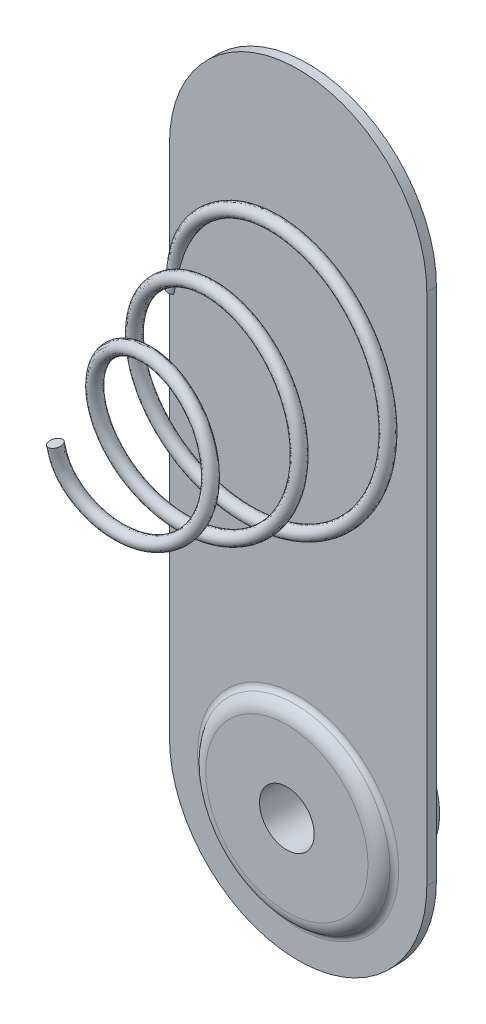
ISO-10303-21;
HEADER;
FILE_DESCRIPTION(('STEP AP214'),'2;1');
FILE_NAME('part.step','',(''),(''),'','','');
FILE_SCHEMA(('AUTOMOTIVE_DESIGN { 1 0 10303 214 1 1 1 1 }'));
ENDSEC;
DATA;
#1=APPLICATION_CONTEXT('core data for automotive mechanical design processes');
#2=APPLICATION_PROTOCOL_DEFINITION('international standard','automotive_design',2000,#1);
#3=PRODUCT_CONTEXT('',#1,'mechanical');
#4=PRODUCT('Part','Part','',(#3));
#5=PRODUCT_RELATED_PRODUCT_CATEGORY('part','',(#4));
#6=PRODUCT_DEFINITION_FORMATION('','',#4);
#7=PRODUCT_DEFINITION_CONTEXT('part definition',#1,'design');
#8=PRODUCT_DEFINITION('design','',#6,#7);
#9=PRODUCT_DEFINITION_SHAPE('','',#8);
#10=(LENGTH_UNIT() NAMED_UNIT(*) SI_UNIT(.MILLI.,.METRE.));
#11=(NAMED_UNIT(*) PLANE_ANGLE_UNIT() SI_UNIT($,.RADIAN.));
#12=(NAMED_UNIT(*) SI_UNIT($,.STERADIAN.) SOLID_ANGLE_UNIT());
#13=UNCERTAINTY_MEASURE_WITH_UNIT(LENGTH_MEASURE(1.E-05),#10,'distance_accuracy_value','');
#14=(GEOMETRIC_REPRESENTATION_CONTEXT(3) GLOBAL_UNCERTAINTY_ASSIGNED_CONTEXT((#13)) GLOBAL_UNIT_ASSIGNED_CONTEXT((#10,
#11,#12)) REPRESENTATION_CONTEXT('',''));
#15=CARTESIAN_POINT('',(0.,0.,0.));
#16=DIRECTION('',(0.,0.,1.));
#17=DIRECTION('',(1.,0.,0.));
#18=AXIS2_PLACEMENT_3D('',#15,#16,#17);
#19=CARTESIAN_POINT('',(0.,-12.,-2.));
#20=DIRECTION('',(0.,0.,1.));
#21=DIRECTION('',(1.,0.,0.));
#22=AXIS2_PLACEMENT_3D('',#19,#20,#21);
#23=CYLINDRICAL_SURFACE('',#22,1.);
#24=CARTESIAN_POINT('',(0.,-12.,-0.15));
#25=DIRECTION('',(0.,0.,1.));
#26=DIRECTION('',(1.,0.,0.));
#27=AXIS2_PLACEMENT_3D('',#24,#25,#26);
#28=CIRCLE('',#27,1.);
#29=CARTESIAN_POINT('',(1.,-12.,-0.15));
#30=VERTEX_POINT('',#29);
#31=EDGE_CURVE('E113',#30,#30,#28,.T.);
#32=ORIENTED_EDGE('',*,*,#31,.F.);
#33=EDGE_LOOP('',(#32));
#34=FACE_BOUND('',#33,.T.);
#35=CARTESIAN_POINT('',(0.,-12.,-1.8));
#36=DIRECTION('',(0.,0.,-1.));
#37=DIRECTION('',(-1.,0.,0.));
#38=AXIS2_PLACEMENT_3D('',#35,#36,#37);
#39=CIRCLE('',#38,1.);
#40=CARTESIAN_POINT('',(-1.,-12.,-1.8));
#41=VERTEX_POINT('',#40);
#42=EDGE_CURVE('E30',#41,#41,#39,.F.);
#43=ORIENTED_EDGE('',*,*,#42,.T.);
#44=EDGE_LOOP('',(#43));
#45=FACE_BOUND('',#44,.T.);
#46=ADVANCED_FACE('F26',(#34,#45),#23,.T.);
#47=CARTESIAN_POINT('',(0.,4.,0.15));
#48=DIRECTION('',(0.,0.,1.));
#49=DIRECTION('',(1.,0.,0.));
#50=AXIS2_PLACEMENT_3D('',#47,#48,#49);
#51=PLANE('',#50);
#52=CARTESIAN_POINT('',(0.,-12.,0.15));
#53=DIRECTION('',(0.,0.,1.));
#54=DIRECTION('',(1.,0.,0.));
#55=AXIS2_PLACEMENT_3D('',#52,#53,#54);
#56=CIRCLE('',#55,3.12924818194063);
#57=CARTESIAN_POINT('',(3.12924818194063,-12.,0.15));
#58=VERTEX_POINT('',#57);
#59=EDGE_CURVE('E35',#58,#58,#56,.F.);
#60=ORIENTED_EDGE('',*,*,#59,.T.);
#61=EDGE_LOOP('',(#60));
#62=FACE_BOUND('',#61,.T.);
#63=DIRECTION('',(1.,0.,0.));
#64=VECTOR('',#63,1.);
#65=CARTESIAN_POINT('',(-4.,0.,0.15));
#66=LINE('',#65,#64);
#67=CARTESIAN_POINT('',(-4.,0.,0.15));
#68=VERTEX_POINT('',#67);
#69=CARTESIAN_POINT('',(-3.86771243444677,0.,0.15));
#70=VERTEX_POINT('',#69);
#71=EDGE_CURVE('E138',#68,#70,#66,.T.);
#72=ORIENTED_EDGE('',*,*,#71,.F.);
#73=DIRECTION('',(0.,-1.,0.));
#74=VECTOR('',#73,1.);
#75=CARTESIAN_POINT('',(-4.,4.,0.15));
#76=LINE('',#75,#74);
#77=CARTESIAN_POINT('',(-4.,-12.,0.15));
#78=VERTEX_POINT('',#77);
#79=EDGE_CURVE('E125',#68,#78,#76,.T.);
#80=ORIENTED_EDGE('',*,*,#79,.T.);
#81=CARTESIAN_POINT('',(0.,-12.,0.15));
#82=DIRECTION('',(0.,0.,1.));
#83=DIRECTION('',(1.,0.,0.));
#84=AXIS2_PLACEMENT_3D('',#81,#82,#83);
#85=CIRCLE('',#84,4.);
#86=CARTESIAN_POINT('',(4.,-12.,0.15));
#87=VERTEX_POINT('',#86);
#88=EDGE_CURVE('E127',#78,#87,#85,.T.);
#89=ORIENTED_EDGE('',*,*,#88,.T.);
#90=DIRECTION('',(0.,1.,0.));
#91=VECTOR('',#90,1.);
#92=CARTESIAN_POINT('',(4.,4.,0.15));
#93=LINE('',#92,#91);
#94=CARTESIAN_POINT('',(4.,4.,0.15));
#95=VERTEX_POINT('',#94);
#96=EDGE_CURVE('E129',#87,#95,#93,.T.);
#97=ORIENTED_EDGE('',*,*,#96,.T.);
#98=CARTESIAN_POINT('',(0.,4.,0.15));
#99=DIRECTION('',(0.,0.,1.));
#100=DIRECTION('',(1.,0.,0.));
#101=AXIS2_PLACEMENT_3D('',#98,#99,#100);
#102=CIRCLE('',#101,4.);
#103=CARTESIAN_POINT('',(-4.,4.,0.15));
#104=VERTEX_POINT('',#103);
#105=EDGE_CURVE('E123',#95,#104,#102,.T.);
#106=ORIENTED_EDGE('',*,*,#105,.T.);
#107=CARTESIAN_POINT('',(-4.,1.04414830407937,0.15));
#108=VERTEX_POINT('',#107);
#109=EDGE_CURVE('E103',#104,#108,#76,.T.);
#110=ORIENTED_EDGE('',*,*,#109,.T.);
#111=CARTESIAN_POINT('',(-3.99999999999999,1.04414830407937,0.15));
#112=CARTESIAN_POINT('',(-3.99282968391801,1.07563880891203,0.150000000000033));
#113=CARTESIAN_POINT('',(-3.9853004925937,1.10704842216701,0.150000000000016));
#114=CARTESIAN_POINT('',(-3.96948688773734,1.16967342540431,0.149999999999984));
#115=CARTESIAN_POINT('',(-3.96120254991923,1.20088883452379,0.149999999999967));
#116=CARTESIAN_POINT('',(-3.94383414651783,1.2631194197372,0.150000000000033));
#117=CARTESIAN_POINT('',(-3.9347495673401,1.29413445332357,0.150000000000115));
#118=CARTESIAN_POINT('',(-3.9157435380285,1.35591189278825,0.149999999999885));
#119=CARTESIAN_POINT('',(-3.90582190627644,1.38667424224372,0.149999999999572));
#120=CARTESIAN_POINT('',(-3.8674718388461,1.50002624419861,0.149999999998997));
#121=CARTESIAN_POINT('',(-3.83628429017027,1.58171885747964,0.149999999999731));
#122=CARTESIAN_POINT('',(-3.76666571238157,1.74197543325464,0.150000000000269));
#123=CARTESIAN_POINT('',(-3.72823317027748,1.8205387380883,0.150000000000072));
#124=CARTESIAN_POINT('',(-3.64479141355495,1.97427386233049,0.149999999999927));
#125=CARTESIAN_POINT('',(-3.5997692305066,2.04943860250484,0.149999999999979));
#126=CARTESIAN_POINT('',(-3.50394634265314,2.19599716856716,0.150000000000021));
#127=CARTESIAN_POINT('',(-3.45314439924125,2.26739018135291,0.150000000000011));
#128=CARTESIAN_POINT('',(-3.34534686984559,2.40759393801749,0.149999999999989));
#129=CARTESIAN_POINT('',(-3.28824854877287,2.47632554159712,0.149999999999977));
#130=CARTESIAN_POINT('',(-3.16911728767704,2.60937089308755,0.150000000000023));
#131=CARTESIAN_POINT('',(-3.10708438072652,2.67368467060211,0.150000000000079));
#132=CARTESIAN_POINT('',(-2.97851275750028,2.79733523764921,0.149999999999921));
#133=CARTESIAN_POINT('',(-2.91198453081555,2.85668293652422,0.149999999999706));
#134=CARTESIAN_POINT('',(-2.77462304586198,2.97013839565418,0.150000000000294));
#135=CARTESIAN_POINT('',(-2.70379139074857,3.02424808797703,0.150000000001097));
#136=CARTESIAN_POINT('',(-2.59081852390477,3.10363635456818,0.15000000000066));
#137=CARTESIAN_POINT('',(-2.55009031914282,3.13094288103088,0.150000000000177));
#138=CARTESIAN_POINT('',(-2.46740049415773,3.18363708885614,0.149999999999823));
#139=CARTESIAN_POINT('',(-2.42543878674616,3.20902463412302,0.149999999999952));
#140=CARTESIAN_POINT('',(-2.34015797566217,3.25773727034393,0.150000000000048));
#141=CARTESIAN_POINT('',(-2.29683501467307,3.2810556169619,0.150000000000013));
#142=CARTESIAN_POINT('',(-2.20895349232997,3.32520670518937,0.149999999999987));
#143=CARTESIAN_POINT('',(-2.16439558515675,3.34604073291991,0.149999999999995));
#144=CARTESIAN_POINT('',(-2.09651676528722,3.37498130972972,0.150000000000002));
#145=CARTESIAN_POINT('',(-2.07369083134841,3.38425212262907,0.150000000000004));
#146=CARTESIAN_POINT('',(-2.02766773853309,3.40186162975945,0.149999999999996));
#147=CARTESIAN_POINT('',(-2.00447040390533,3.41019986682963,0.149999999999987));
#148=CARTESIAN_POINT('',(-1.95782897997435,3.42563892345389,0.150000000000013));
#149=CARTESIAN_POINT('',(-1.93438760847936,3.43274770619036,0.150000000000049));
#150=CARTESIAN_POINT('',(-1.89886918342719,3.44208046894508,0.149999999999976));
#151=CARTESIAN_POINT('',(-1.88696719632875,3.44497022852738,0.14999999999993));
#152=CARTESIAN_POINT('',(-1.86303334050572,3.45013949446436,0.15000000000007));
#153=CARTESIAN_POINT('',(-1.85100157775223,3.45241946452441,0.150000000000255));
#154=CARTESIAN_POINT('',(-1.83087322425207,3.45540348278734,0.149999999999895));
#155=CARTESIAN_POINT('',(-1.82281702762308,3.45637968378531,0.149999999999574));
#156=CARTESIAN_POINT('',(-1.80666017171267,3.45768042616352,0.150000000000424));
#157=CARTESIAN_POINT('',(-1.79855973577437,3.4580070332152,0.150000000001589));
#158=CARTESIAN_POINT('',(-1.78639393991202,3.45753761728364,0.1500000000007));
#159=CARTESIAN_POINT('',(-1.78231564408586,3.45721719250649,0.149999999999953));
#160=CARTESIAN_POINT('',(-1.77424581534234,3.45604790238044,0.150000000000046));
#161=CARTESIAN_POINT('',(-1.77025394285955,3.45520177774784,0.150000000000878));
#162=CARTESIAN_POINT('',(-1.76332451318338,3.45277828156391,0.150000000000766));
#163=CARTESIAN_POINT('',(-1.7603365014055,3.451382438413,0.150000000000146));
#164=CARTESIAN_POINT('',(-1.75610573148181,3.44821314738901,0.14999999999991));
#165=CARTESIAN_POINT('',(-1.7546296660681,3.4467803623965,0.150000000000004));
#166=CARTESIAN_POINT('',(-1.75228546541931,3.44344941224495,0.149999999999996));
#167=CARTESIAN_POINT('',(-1.75142136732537,3.44154826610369,0.149999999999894));
#168=CARTESIAN_POINT('',(-1.75048353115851,3.43777716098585,0.150000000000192));
#169=CARTESIAN_POINT('',(-1.7503405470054,3.4359224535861,0.150000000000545));
#170=CARTESIAN_POINT('',(-1.75053843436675,3.43083224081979,0.150000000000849));
#171=CARTESIAN_POINT('',(-1.75133538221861,3.42763052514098,0.150000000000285));
#172=CARTESIAN_POINT('',(-1.75392554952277,3.42038001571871,0.149999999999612));
#173=CARTESIAN_POINT('',(-1.75597464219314,3.41644294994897,0.149999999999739));
#174=CARTESIAN_POINT('',(-1.76056678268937,3.40884834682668,0.150000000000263));
#175=CARTESIAN_POINT('',(-1.76311322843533,3.40519298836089,0.150000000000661));
#176=CARTESIAN_POINT('',(-1.77161395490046,3.39390439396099,0.150000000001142));
#177=CARTESIAN_POINT('',(-1.77805488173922,3.38664718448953,0.150000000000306));
#178=CARTESIAN_POINT('',(-1.79141476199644,3.37258203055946,0.149999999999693));
#179=CARTESIAN_POINT('',(-1.79833498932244,3.3657753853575,0.149999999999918));
#180=CARTESIAN_POINT('',(-1.8124488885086,3.35243940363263,0.150000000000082));
#181=CARTESIAN_POINT('',(-1.81964274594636,3.34591026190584,0.150000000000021));
#182=CARTESIAN_POINT('',(-1.83417691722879,3.3330419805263,0.149999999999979));
#183=CARTESIAN_POINT('',(-1.84151699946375,3.32670257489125,0.149999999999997));
#184=CARTESIAN_POINT('',(-1.8635045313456,3.30801691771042,0.150000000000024));
#185=CARTESIAN_POINT('',(-1.87829726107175,3.29584196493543,0.150000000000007));
#186=CARTESIAN_POINT('',(-1.90805516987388,3.27170417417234,0.149999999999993));
#187=CARTESIAN_POINT('',(-1.92302036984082,3.25974136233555,0.149999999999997));
#188=CARTESIAN_POINT('',(-1.96803929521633,3.22396299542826,0.150000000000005));
#189=CARTESIAN_POINT('',(-1.9981944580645,3.20027531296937,0.150000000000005));
#190=CARTESIAN_POINT('',(-2.0583493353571,3.15277813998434,0.149999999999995));
#191=CARTESIAN_POINT('',(-2.08834919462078,3.1289688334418,0.149999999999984));
#192=CARTESIAN_POINT('',(-2.14805994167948,3.08100161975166,0.150000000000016));
#193=CARTESIAN_POINT('',(-2.1777708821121,3.05684377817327,0.150000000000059));
#194=CARTESIAN_POINT('',(-2.26464960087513,2.98503221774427,0.150000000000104));
#195=CARTESIAN_POINT('',(-2.32127529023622,2.93671461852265,0.150000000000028));
#196=CARTESIAN_POINT('',(-2.43259833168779,2.83791014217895,0.149999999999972));
#197=CARTESIAN_POINT('',(-2.48729561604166,2.7874231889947,0.14999999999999));
#198=CARTESIAN_POINT('',(-2.64812587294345,2.63236190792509,0.15000000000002));
#199=CARTESIAN_POINT('',(-2.75092588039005,2.52424490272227,0.150000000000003));
#200=CARTESIAN_POINT('',(-2.89664927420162,2.355180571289,0.149999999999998));
#201=CARTESIAN_POINT('',(-2.94373725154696,2.29778221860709,0.15));
#202=CARTESIAN_POINT('',(-3.0349653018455,2.18069150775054,0.15));
#203=CARTESIAN_POINT('',(-3.07910509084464,2.12099892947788,0.149999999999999));
#204=CARTESIAN_POINT('',(-3.20630314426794,1.9384919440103,0.150000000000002));
#205=CARTESIAN_POINT('',(-3.28433970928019,1.81202091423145,0.150000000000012));
#206=CARTESIAN_POINT('',(-3.37052220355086,1.64884301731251,0.149999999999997));
#207=CARTESIAN_POINT('',(-3.38697676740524,1.61640518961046,0.149999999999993));
#208=CARTESIAN_POINT('',(-3.41876164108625,1.55098309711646,0.150000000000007));
#209=CARTESIAN_POINT('',(-3.43409203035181,1.51799887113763,0.150000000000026));
#210=CARTESIAN_POINT('',(-3.47845311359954,1.41832852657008,0.149999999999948));
#211=CARTESIAN_POINT('',(-3.50585850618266,1.35091564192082,0.149999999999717));
#212=CARTESIAN_POINT('',(-3.55690407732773,1.21462750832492,0.150000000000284));
#213=CARTESIAN_POINT('',(-3.580540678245,1.14575093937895,0.150000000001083));
#214=CARTESIAN_POINT('',(-3.62466132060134,1.00699862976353,0.149999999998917));
#215=CARTESIAN_POINT('',(-3.6451451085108,0.937122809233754,0.149999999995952));
#216=CARTESIAN_POINT('',(-3.69111190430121,0.769266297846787,0.14999999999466));
#217=CARTESIAN_POINT('',(-3.71542214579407,0.670969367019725,0.149999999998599));
#218=CARTESIAN_POINT('',(-3.76154048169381,0.473873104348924,0.150000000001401));
#219=CARTESIAN_POINT('',(-3.78334990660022,0.375074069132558,0.150000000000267));
#220=CARTESIAN_POINT('',(-3.81540232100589,0.230186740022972,0.149999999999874));
#221=CARTESIAN_POINT('',(-3.82561001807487,0.184091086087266,0.149999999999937));
#222=CARTESIAN_POINT('',(-3.8463457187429,0.0919734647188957,0.150000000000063));
#223=CARTESIAN_POINT('',(-3.85687371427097,0.0459514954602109,0.150000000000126));
#224=CARTESIAN_POINT('',(-3.86771243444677,0.,0.15));
#225=B_SPLINE_CURVE_WITH_KNOTS('',3,(#111,#112,#113,#114,#115,#116,#117,#118,#119,#120,#121,
#122,#123,#124,#125,#126,#127,#128,#129,#130,#131,#132,#133,#134,#135,#136,#137,#138,#139,#140,
#141,#142,#143,#144,#145,#146,#147,#148,#149,#150,#151,#152,#153,#154,#155,#156,#157,#158,#159,
#160,#161,#162,#163,#164,#165,#166,#167,#168,#169,#170,#171,#172,#173,#174,#175,#176,#177,#178,
#179,#180,#181,#182,#183,#184,#185,#186,#187,#188,#189,#190,#191,#192,#193,#194,#195,#196,#197,
#198,#199,#200,#201,#202,#203,#204,#205,#206,#207,#208,#209,#210,#211,#212,#213,#214,#215,#216,
#217,#218,#219,#220,#221,#222,#223,#224),.UNSPECIFIED.,.F.,.F.,(4,2,2,2,2,2,2,2,2,2,2,2,2,2,2,2,
2,2,2,2,2,2,2,2,2,2,2,2,2,2,2,2,2,2,2,2,2,2,2,2,2,2,2,2,2,2,2,2,2,2,2,2,2,2,2,2,4),(0.,
0.0968884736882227,0.193767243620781,0.290708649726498,0.387671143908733,0.649653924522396,
0.911691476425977,1.17425183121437,1.43686855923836,1.70468618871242,1.97250202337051,
2.23971317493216,2.50682538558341,2.65388739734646,2.80095982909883,2.94849525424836,
3.0959539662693,3.169848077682,3.24377825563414,3.31721002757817,3.35394487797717,
3.39065171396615,3.41498736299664,3.43924550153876,3.45149819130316,3.46368753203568,
3.47342268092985,3.47948824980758,3.48559346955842,3.49109949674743,3.50083524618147,
3.5140874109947,3.52743349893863,3.55647093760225,3.58558875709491,3.61472668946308,
3.64382165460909,3.70129142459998,3.75876823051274,3.87380648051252,3.98870430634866,
4.10358079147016,4.32683989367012,4.55010683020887,4.99691530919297,5.21955531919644,
5.44221674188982,5.88663587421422,5.99574118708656,6.10483878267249,6.32300319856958,
6.54137349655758,6.75976134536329,7.0634571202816,7.36699056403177,7.5086268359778,
7.6502595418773),.UNSPECIFIED.);
#226=EDGE_CURVE('E51',#108,#70,#225,.T.);
#227=ORIENTED_EDGE('',*,*,#226,.T.);
#228=EDGE_LOOP('',(#72,#80,#89,#97,#106,#110,#227));
#229=FACE_BOUND('',#228,.T.);
#230=ADVANCED_FACE('F172',(#62,#229),#51,.T.);
#231=CARTESIAN_POINT('',(-1.69681578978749,0.,5.99999999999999));
#232=DIRECTION('',(-0.190719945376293,0.975695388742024,0.107909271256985));
#233=DIRECTION('',(0.0461119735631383,-0.100901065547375,0.993827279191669));
#234=AXIS2_PLACEMENT_3D('',#231,#232,#233);
#235=PLANE('',#234);
#236=CARTESIAN_POINT('',(-1.69681578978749,0.,5.99999999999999));
#237=DIRECTION('',(-0.190719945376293,0.975695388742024,0.107909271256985));
#238=DIRECTION('',(0.0461119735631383,-0.100901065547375,0.993827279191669));
#239=AXIS2_PLACEMENT_3D('',#236,#237,#238);
#240=CIRCLE('',#239,0.2);
#241=CARTESIAN_POINT('',(-1.68759339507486,-0.0201802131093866,6.19876545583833));
#242=VERTEX_POINT('',#241);
#243=EDGE_CURVE('E142',#242,#242,#240,.T.);
#244=ORIENTED_EDGE('',*,*,#243,.T.);
#245=EDGE_LOOP('',(#244));
#246=FACE_BOUND('',#245,.T.);
#247=ADVANCED_FACE('F176',(#246),#235,.T.);
#248=CARTESIAN_POINT('',(-4.,0.,0.));
#249=DIRECTION('',(0.,1.,0.));
#250=DIRECTION('',(0.,0.,1.));
#251=AXIS2_PLACEMENT_3D('',#248,#249,#250);
#252=PLANE('',#251);
#253=DIRECTION('',(0.,0.,-1.));
#254=VECTOR('',#253,1.);
#255=CARTESIAN_POINT('',(-4.,0.,0.));
#256=LINE('',#255,#254);
#257=CARTESIAN_POINT('',(-4.,0.,-0.15));
#258=VERTEX_POINT('',#257);
#259=EDGE_CURVE('E140',#68,#258,#256,.T.);
#260=ORIENTED_EDGE('',*,*,#259,.F.);
#261=ORIENTED_EDGE('',*,*,#71,.T.);
#262=CARTESIAN_POINT('',(-4.,0.,0.));
#263=DIRECTION('',(0.,1.,0.));
#264=DIRECTION('',(0.,0.,1.));
#265=AXIS2_PLACEMENT_3D('',#262,#263,#264);
#266=CIRCLE('',#265,0.2);
#267=CARTESIAN_POINT('',(-3.86771243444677,0.,-0.15));
#268=VERTEX_POINT('',#267);
#269=EDGE_CURVE('E145',#268,#70,#266,.T.);
#270=ORIENTED_EDGE('',*,*,#269,.F.);
#271=DIRECTION('',(1.,0.,0.));
#272=VECTOR('',#271,1.);
#273=CARTESIAN_POINT('',(-4.,0.,-0.15));
#274=LINE('',#273,#272);
#275=EDGE_CURVE('E43',#258,#268,#274,.T.);
#276=ORIENTED_EDGE('',*,*,#275,.F.);
#277=EDGE_LOOP('',(#260,#261,#270,#276));
#278=FACE_BOUND('',#277,.T.);
#279=ADVANCED_FACE('F28',(#278),#252,.F.);
#280=CARTESIAN_POINT('',(-4.,0.,0.2));
#281=CARTESIAN_POINT('',(-3.95955414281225,0.278530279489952,0.22231873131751));
#282=CARTESIAN_POINT('',(-3.88019416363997,0.831714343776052,0.266636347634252));
#283=CARTESIAN_POINT('',(-3.63186594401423,1.63967999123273,0.33515891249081));
#284=CARTESIAN_POINT('',(-3.17585543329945,2.35401811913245,0.403186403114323));
#285=CARTESIAN_POINT('',(-2.57881752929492,2.95453459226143,0.471251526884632));
#286=CARTESIAN_POINT('',(-1.86945368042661,3.41853640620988,0.540499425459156));
#287=CARTESIAN_POINT('',(-1.07763703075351,3.7169636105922,0.610139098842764));
#288=CARTESIAN_POINT('',(-0.239708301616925,3.83635074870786,0.680021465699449));
#289=CARTESIAN_POINT('',(0.604434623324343,3.76840666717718,0.750499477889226));
#290=CARTESIAN_POINT('',(1.41293679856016,3.51674324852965,0.821507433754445));
#291=CARTESIAN_POINT('',(2.14482614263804,3.09100035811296,0.892996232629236));
#292=CARTESIAN_POINT('',(2.76357270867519,2.51298302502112,0.965024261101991));
#293=CARTESIAN_POINT('',(3.22775405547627,1.82173380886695,1.03635330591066));
#294=CARTESIAN_POINT('',(3.52203069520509,1.05905829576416,1.1069765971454));
#295=CARTESIAN_POINT('',(3.64188736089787,0.264691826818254,1.17685270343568));
#296=CARTESIAN_POINT('',(3.58434158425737,-0.536572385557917,1.24726413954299));
#297=CARTESIAN_POINT('',(3.35249232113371,-1.30575421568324,1.31819259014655));
#298=CARTESIAN_POINT('',(2.95473931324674,-2.00378317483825,1.38966023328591));
#299=CARTESIAN_POINT('',(2.41158475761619,-2.5957288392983,1.46169312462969));
#300=CARTESIAN_POINT('',(1.74856085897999,-3.04955487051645,1.53426884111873));
#301=CARTESIAN_POINT('',(0.999871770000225,-3.34100716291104,1.60745051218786));
#302=CARTESIAN_POINT('',(0.204299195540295,-3.45362267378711,1.68120053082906));
#303=CARTESIAN_POINT('',(-0.595715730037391,-3.37885024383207,1.75557237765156));
#304=CARTESIAN_POINT('',(-1.35663811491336,-3.12074226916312,1.83056704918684));
#305=CARTESIAN_POINT('',(-2.03548153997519,-2.69069885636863,1.90618545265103));
#306=CARTESIAN_POINT('',(-2.59341536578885,-2.11243398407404,1.9824822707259));
#307=CARTESIAN_POINT('',(-2.99752872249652,-1.41778085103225,2.05943085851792));
#308=CARTESIAN_POINT('',(-3.22190496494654,-0.646127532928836,2.13707338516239));
#309=CARTESIAN_POINT('',(-3.25161239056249,0.12746459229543,2.21256402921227));
#310=CARTESIAN_POINT('',(-3.10699729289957,0.855979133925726,2.28571262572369));
#311=CARTESIAN_POINT('',(-2.81761493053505,1.50790160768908,2.35658192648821));
#312=CARTESIAN_POINT('',(-2.39099870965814,2.07952927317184,2.42802660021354));
#313=CARTESIAN_POINT('',(-1.84686186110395,2.54069240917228,2.50011159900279));
#314=CARTESIAN_POINT('',(-1.21301058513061,2.86777358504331,2.57282750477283));
#315=CARTESIAN_POINT('',(-0.521108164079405,3.04122326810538,2.64619065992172));
#316=CARTESIAN_POINT('',(0.192083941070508,3.05151550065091,2.72024628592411));
#317=CARTESIAN_POINT('',(0.888273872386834,2.89605399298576,2.79496729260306));
#318=CARTESIAN_POINT('',(1.52858106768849,2.58171231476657,2.87042224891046));
#319=CARTESIAN_POINT('',(2.07688154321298,2.12543639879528,2.94659753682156));
#320=CARTESIAN_POINT('',(2.50009608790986,1.5511735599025,3.02352034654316));
#321=CARTESIAN_POINT('',(2.77279333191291,0.892036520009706,3.10123988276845));
#322=CARTESIAN_POINT('',(2.87713019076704,0.186353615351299,3.17973051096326));
#323=CARTESIAN_POINT('',(2.80692690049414,-0.49726270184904,3.25615512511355));
#324=CARTESIAN_POINT('',(2.58805098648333,-1.11904809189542,3.3303312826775));
#325=CARTESIAN_POINT('',(2.24949422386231,-1.65401623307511,3.40224583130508));
#326=CARTESIAN_POINT('',(1.79919582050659,-2.09892721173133,3.47489438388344));
#327=CARTESIAN_POINT('',(1.25947859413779,-2.42976811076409,3.54825053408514));
#328=CARTESIAN_POINT('',(0.658030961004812,-2.62720733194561,3.62238413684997));
#329=CARTESIAN_POINT('',(0.027246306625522,-2.68003573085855,3.69728969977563));
#330=CARTESIAN_POINT('',(-0.598271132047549,-2.58284850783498,3.77299294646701));
#331=CARTESIAN_POINT('',(-1.18288773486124,-2.34022520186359,3.84954880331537));
#332=CARTESIAN_POINT('',(-1.69234220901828,-1.96455269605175,3.9269397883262));
#333=CARTESIAN_POINT('',(-2.09514081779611,-1.47627936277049,4.00523504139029));
#334=CARTESIAN_POINT('',(-2.36618506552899,-0.90433465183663,4.08445252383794));
#335=CARTESIAN_POINT('',(-2.48668149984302,-0.282956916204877,4.16460469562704));
#336=CARTESIAN_POINT('',(-2.44705540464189,0.348740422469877,4.24576909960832));
#337=CARTESIAN_POINT('',(-2.24852248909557,0.94959231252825,4.32793691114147));
#338=CARTESIAN_POINT('',(-1.93033490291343,1.43531523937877,4.4042982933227));
#339=CARTESIAN_POINT('',(-1.54979578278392,1.79689934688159,4.47442894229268));
#340=CARTESIAN_POINT('',(-1.14937720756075,2.04834591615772,4.53822010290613));
#341=CARTESIAN_POINT('',(-0.706628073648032,2.21405008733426,4.60269570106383));
#342=CARTESIAN_POINT('',(-0.239605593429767,2.2869694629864,4.66782485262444));
#343=CARTESIAN_POINT('',(0.232399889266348,2.26230722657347,4.73368666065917));
#344=CARTESIAN_POINT('',(0.689124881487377,2.14096549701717,4.8002500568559));
#345=CARTESIAN_POINT('',(1.11009509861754,1.92630368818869,4.8675858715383));
#346=CARTESIAN_POINT('',(1.47634963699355,1.62787147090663,4.93568569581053));
#347=CARTESIAN_POINT('',(1.76987626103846,1.25770088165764,5.00459422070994));
#348=CARTESIAN_POINT('',(1.97645661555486,0.832957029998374,5.07434448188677));
#349=CARTESIAN_POINT('',(2.08484953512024,0.37331520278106,5.14493689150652));
#350=CARTESIAN_POINT('',(2.08828640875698,-0.0815187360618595,5.21383128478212));
#351=CARTESIAN_POINT('',(1.99896994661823,-0.50869676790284,5.28081616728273));
#352=CARTESIAN_POINT('',(1.83174079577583,-0.892925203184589,5.34594136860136));
#353=CARTESIAN_POINT('',(1.58967030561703,-1.23482790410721,5.41181809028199));
#354=CARTESIAN_POINT('',(1.28172852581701,-1.51878461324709,5.47854763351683));
#355=CARTESIAN_POINT('',(0.921425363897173,-1.73211665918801,5.5460873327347));
#356=CARTESIAN_POINT('',(0.523884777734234,-1.86350543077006,5.61455451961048));
#357=CARTESIAN_POINT('',(0.107425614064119,-1.9062563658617,5.68394297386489));
#358=CARTESIAN_POINT('',(-0.308113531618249,-1.85744169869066,5.75418312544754));
#359=CARTESIAN_POINT('',(-0.702761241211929,-1.71905175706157,5.82544460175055));
#360=CARTESIAN_POINT('',(-1.05384131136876,-1.4908370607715,5.89815976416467));
#361=CARTESIAN_POINT('',(-1.34684599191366,-1.193133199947,5.97139603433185));
#362=CARTESIAN_POINT('',(-1.57409379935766,-0.840994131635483,6.0450490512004));
#363=CARTESIAN_POINT('',(-1.67196014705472,-0.433928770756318,6.12242305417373));
#364=CARTESIAN_POINT('',(-1.68138576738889,-0.158676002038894,6.17320315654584));
#365=CARTESIAN_POINT('',(-1.68759339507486,-0.0201802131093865,6.19876545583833));
#366=CARTESIAN_POINT('',(-3.6,0.,0.2));
#367=CARTESIAN_POINT('',(-3.55951483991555,0.278800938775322,0.222340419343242));
#368=CARTESIAN_POINT('',(-3.47849824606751,0.816170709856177,0.265779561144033));
#369=CARTESIAN_POINT('',(-3.24385775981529,1.52418171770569,0.3251039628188));
#370=CARTESIAN_POINT('',(-2.8299265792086,2.14690012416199,0.395710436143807));
#371=CARTESIAN_POINT('',(-2.28147475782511,2.68305671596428,0.467385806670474));
#372=CARTESIAN_POINT('',(-1.63562609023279,3.08999739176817,0.534510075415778));
#373=CARTESIAN_POINT('',(-0.922714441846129,3.34471341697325,0.603503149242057));
#374=CARTESIAN_POINT('',(-0.168582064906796,3.43949322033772,0.674353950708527));
#375=CARTESIAN_POINT('',(0.585833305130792,3.36552080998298,0.744727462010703));
#376=CARTESIAN_POINT('',(1.30592116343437,3.12793259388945,0.815529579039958));
#377=CARTESIAN_POINT('',(1.95384209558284,2.73565748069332,0.887352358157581));
#378=CARTESIAN_POINT('',(2.4972567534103,2.21000690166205,0.959155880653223));
#379=CARTESIAN_POINT('',(2.90127295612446,1.58493039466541,1.03085118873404));
#380=CARTESIAN_POINT('',(3.15115608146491,0.900959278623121,1.10124479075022));
#381=CARTESIAN_POINT('',(3.24561741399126,0.190235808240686,1.17140195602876));
#382=CARTESIAN_POINT('',(3.18133068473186,-0.521321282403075,1.24174615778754));
#383=CARTESIAN_POINT('',(2.96272341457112,-1.20225425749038,1.31270041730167));
#384=CARTESIAN_POINT('',(2.59778063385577,-1.8158158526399,1.38438833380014));
#385=CARTESIAN_POINT('',(2.10626186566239,-2.33210199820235,1.45619730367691));
#386=CARTESIAN_POINT('',(1.51012483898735,-2.72403536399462,1.52917377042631));
#387=CARTESIAN_POINT('',(0.842837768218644,-2.96926911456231,1.60213166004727));
#388=CARTESIAN_POINT('',(0.13603059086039,-3.05587189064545,1.67613218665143));
#389=CARTESIAN_POINT('',(-0.569346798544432,-2.97599211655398,1.75055547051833));
#390=CARTESIAN_POINT('',(-1.23681777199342,-2.73526041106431,1.8254023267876));
#391=CARTESIAN_POINT('',(-1.82859039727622,-2.34389968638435,1.90142199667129));
#392=CARTESIAN_POINT('',(-2.30939562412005,-1.82530910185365,1.97751058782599));
#393=CARTESIAN_POINT('',(-2.65337081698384,-1.2064064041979,2.05468284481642));
#394=CARTESIAN_POINT('',(-2.83655323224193,-0.524534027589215,2.13246154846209));
#395=CARTESIAN_POINT('',(-2.84893327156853,0.154525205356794,2.20774741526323));
#396=CARTESIAN_POINT('',(-2.70891302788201,0.791373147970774,2.28133895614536));
#397=CARTESIAN_POINT('',(-2.44400151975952,1.35595715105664,2.3519619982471));
#398=CARTESIAN_POINT('',(-2.06005946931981,1.84891216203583,2.42371742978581));
#399=CARTESIAN_POINT('',(-1.57672945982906,2.24096902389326,2.49580851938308));
#400=CARTESIAN_POINT('',(-1.01761838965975,2.51477939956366,2.56843391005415));
#401=CARTESIAN_POINT('',(-0.411490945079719,2.65276312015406,2.64220536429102));
#402=CARTESIAN_POINT('',(0.208382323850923,2.64822348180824,2.71597745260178));
#403=CARTESIAN_POINT('',(0.811053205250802,2.49979634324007,2.79113188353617));
#404=CARTESIAN_POINT('',(1.35953040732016,2.21496764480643,2.86651374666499));
#405=CARTESIAN_POINT('',(1.82593219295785,1.8090662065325,2.94266192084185));
#406=CARTESIAN_POINT('',(2.18054163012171,1.30398394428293,3.01999530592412));
#407=CARTESIAN_POINT('',(2.40260899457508,0.730199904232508,3.09747919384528));
#408=CARTESIAN_POINT('',(2.47867560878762,0.119104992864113,3.17630547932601));
#409=CARTESIAN_POINT('',(2.40424286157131,-0.46714882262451,3.2528736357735));
#410=CARTESIAN_POINT('',(2.2037300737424,-0.996657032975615,3.32680913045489));
#411=CARTESIAN_POINT('',(1.90206368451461,-1.44884796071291,3.39928886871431));
#412=CARTESIAN_POINT('',(1.50787958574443,-1.81972156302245,3.47161502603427));
#413=CARTESIAN_POINT('',(1.03895273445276,-2.09176316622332,3.54542504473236));
#414=CARTESIAN_POINT('',(0.52236085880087,-2.24696990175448,3.61954740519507));
#415=CARTESIAN_POINT('',(-0.0162045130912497,-2.27867871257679,3.69436501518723));
#416=CARTESIAN_POINT('',(-0.545830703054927,-2.1823768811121,3.7705960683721));
#417=CARTESIAN_POINT('',(-1.03573060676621,-1.96407689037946,3.84686566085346));
#418=CARTESIAN_POINT('',(-1.45942783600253,-1.63446298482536,3.92469247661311));
#419=CARTESIAN_POINT('',(-1.78820114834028,-1.21332281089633,4.00310752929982));
#420=CARTESIAN_POINT('',(-2.00377571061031,-0.725418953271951,4.08213088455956));
#421=CARTESIAN_POINT('',(-2.09104643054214,-0.199591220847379,4.16287007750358));
#422=CARTESIAN_POINT('',(-2.04307195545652,0.328697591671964,4.24402831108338));
#423=CARTESIAN_POINT('',(-1.86309097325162,0.826932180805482,4.32603322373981));
#424=CARTESIAN_POINT('',(-1.5856849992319,1.22518767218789,4.40313891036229));
#425=CARTESIAN_POINT('',(-1.26089441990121,1.51642716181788,4.47286372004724));
#426=CARTESIAN_POINT('',(-0.921417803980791,1.71633088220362,4.53732322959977));
#427=CARTESIAN_POINT('',(-0.55129840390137,1.84242155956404,4.60142449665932));
#428=CARTESIAN_POINT('',(-0.162219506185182,1.89162202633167,4.6671835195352));
#429=CARTESIAN_POINT('',(0.225590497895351,1.85944879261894,4.73278313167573));
#430=CARTESIAN_POINT('',(0.599555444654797,1.74807513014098,4.79982608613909));
#431=CARTESIAN_POINT('',(0.938872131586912,1.56141526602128,4.86714083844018));
#432=CARTESIAN_POINT('',(1.2319405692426,1.30732321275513,4.9353972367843));
#433=CARTESIAN_POINT('',(1.46164388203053,0.997720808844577,5.00472025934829));
#434=CARTESIAN_POINT('',(1.61902493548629,0.646294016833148,5.07407040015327));
#435=CARTESIAN_POINT('',(1.69490395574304,0.269981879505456,5.14561626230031));
#436=CARTESIAN_POINT('',(1.68556260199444,-0.0977303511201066,5.21395442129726));
#437=CARTESIAN_POINT('',(1.60190934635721,-0.440941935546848,5.28188340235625));
#438=CARTESIAN_POINT('',(1.45713219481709,-0.744755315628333,5.34649300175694));
#439=CARTESIAN_POINT('',(1.25309844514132,-1.01330146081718,5.41324016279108));
#440=CARTESIAN_POINT('',(0.999581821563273,-1.23102862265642,5.47957722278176));
#441=CARTESIAN_POINT('',(0.705611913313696,-1.39169290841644,5.54794103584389));
#442=CARTESIAN_POINT('',(0.386918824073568,-1.48430367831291,5.61628422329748));
#443=CARTESIAN_POINT('',(0.055294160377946,-1.5064234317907,5.68536293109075));
#444=CARTESIAN_POINT('',(-0.270497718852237,-1.45582046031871,5.75680169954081));
#445=CARTESIAN_POINT('',(-0.575832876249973,-1.33601367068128,5.83005382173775));
#446=CARTESIAN_POINT('',(-0.843179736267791,-1.14691123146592,5.89790568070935));
#447=CARTESIAN_POINT('',(-1.06757017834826,-0.902397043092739,5.97248945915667));
#448=CARTESIAN_POINT('',(-1.22890261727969,-0.62705266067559,6.05895592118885));
#449=CARTESIAN_POINT('',(-1.2805065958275,-0.335986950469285,6.11647968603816));
#450=CARTESIAN_POINT('',(-1.28914787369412,-0.0811709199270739,6.16284839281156));
#451=CARTESIAN_POINT('',(-1.29536905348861,0.0576272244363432,6.18846649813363));
#452=CARTESIAN_POINT('',(-3.6,0.,-0.2));
#453=CARTESIAN_POINT('',(-3.55951483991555,0.278800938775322,-0.177659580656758));
#454=CARTESIAN_POINT('',(-3.47949589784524,0.81633197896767,-0.134242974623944));
#455=CARTESIAN_POINT('',(-3.25303768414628,1.52906590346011,-0.0747781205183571));
#456=CARTESIAN_POINT('',(-2.83536203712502,2.15240526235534,-0.00421849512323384));
#457=CARTESIAN_POINT('',(-2.28339906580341,2.68676146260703,0.0674036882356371));
#458=CARTESIAN_POINT('',(-1.63747736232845,3.09613944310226,0.134560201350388));
#459=CARTESIAN_POINT('',(-0.923046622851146,3.35182718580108,0.203565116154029));
#460=CARTESIAN_POINT('',(-0.167133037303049,3.44556976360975,0.274401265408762));
#461=CARTESIAN_POINT('',(0.588810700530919,3.37123409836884,0.34477836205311));
#462=CARTESIAN_POINT('',(1.31046355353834,3.13294864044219,0.415585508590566));
#463=CARTESIAN_POINT('',(1.95937758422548,2.7391692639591,0.487404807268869));
#464=CARTESIAN_POINT('',(2.50381802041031,2.21214036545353,0.559214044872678));
#465=CARTESIAN_POINT('',(2.90796705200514,1.58518694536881,0.630905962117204));
#466=CARTESIAN_POINT('',(3.15805455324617,0.899552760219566,0.701305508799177));
#467=CARTESIAN_POINT('',(3.25182027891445,0.187078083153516,0.771461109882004));
#468=CARTESIAN_POINT('',(3.18674217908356,-0.526012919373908,0.841809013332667));
#469=CARTESIAN_POINT('',(2.96685963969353,-1.2083188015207,0.912766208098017));
#470=CARTESIAN_POINT('',(2.60017475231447,-1.82273315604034,0.98445388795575));
#471=CARTESIAN_POINT('',(2.10697385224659,-2.33978571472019,1.0562700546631));
#472=CARTESIAN_POINT('',(1.50867308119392,-2.73149880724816,1.1292442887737));
#473=CARTESIAN_POINT('',(0.83950686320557,-2.97652592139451,1.20220969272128));
#474=CARTESIAN_POINT('',(0.130782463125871,-3.06198210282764,1.27621120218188));
#475=CARTESIAN_POINT('',(-0.576124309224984,-2.98065059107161,1.35063830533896));
#476=CARTESIAN_POINT('',(-1.2449118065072,-2.73822553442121,1.42549289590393));
#477=CARTESIAN_POINT('',(-1.83717219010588,-2.344410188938,1.50151208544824));
#478=CARTESIAN_POINT('',(-2.31824660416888,-1.82365359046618,1.57760974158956));
#479=CARTESIAN_POINT('',(-2.66157042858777,-1.20226115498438,1.65478548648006));
#480=CARTESIAN_POINT('',(-2.84346628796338,-0.518217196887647,1.73256881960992));
#481=CARTESIAN_POINT('',(-2.85437526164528,0.162700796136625,1.80786511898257));
#482=CARTESIAN_POINT('',(-2.71188299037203,0.800758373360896,1.88145759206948));
#483=CARTESIAN_POINT('',(-2.44489216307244,1.36619605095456,1.95209159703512));
#484=CARTESIAN_POINT('',(-2.05821248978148,1.85920356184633,2.02385098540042));
#485=CARTESIAN_POINT('',(-1.57237279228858,2.25077924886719,2.09595005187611));
#486=CARTESIAN_POINT('',(-1.01081020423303,2.52363906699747,2.16858643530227));
#487=CARTESIAN_POINT('',(-0.402451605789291,2.65952458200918,2.24236135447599));
#488=CARTESIAN_POINT('',(0.219173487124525,2.65299789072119,2.31614795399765));
#489=CARTESIAN_POINT('',(0.822937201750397,2.5014529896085,2.39130751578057));
#490=CARTESIAN_POINT('',(1.37183688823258,2.21367831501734,2.4667016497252));
#491=CARTESIAN_POINT('',(1.83798763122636,1.8046114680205,2.54286337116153));
#492=CARTESIAN_POINT('',(2.19107109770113,1.29624765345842,2.62020394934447));
#493=CARTESIAN_POINT('',(2.41134687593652,0.719786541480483,2.69770530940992));
#494=CARTESIAN_POINT('',(2.48436760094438,0.106356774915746,2.77654271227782));
#495=CARTESIAN_POINT('',(2.4065520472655,-0.481234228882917,2.85312381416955));
#496=CARTESIAN_POINT('',(2.20276538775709,-1.01147510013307,2.9270791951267));
#497=CARTESIAN_POINT('',(1.89715315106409,-1.46309816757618,2.99956728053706));
#498=CARTESIAN_POINT('',(1.4997252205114,-1.83305676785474,3.07191491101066));
#499=CARTESIAN_POINT('',(1.02734839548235,-2.10277660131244,3.14573789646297));
#500=CARTESIAN_POINT('',(0.508109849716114,-2.25513805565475,3.21987899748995));
#501=CARTESIAN_POINT('',(-0.032553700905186,-2.28345081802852,3.2947195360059));
#502=CARTESIAN_POINT('',(-0.563194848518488,-2.18258605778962,3.37096517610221));
#503=CARTESIAN_POINT('',(-1.05328246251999,-1.96016416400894,3.44726192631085));
#504=CARTESIAN_POINT('',(-1.47574059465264,-1.62577868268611,3.52510906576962));
#505=CARTESIAN_POINT('',(-1.8021237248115,-1.20045227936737,3.60354833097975));
#506=CARTESIAN_POINT('',(-2.01456393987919,-0.708972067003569,3.68260338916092));
#507=CARTESIAN_POINT('',(-2.09694863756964,-0.180299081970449,3.76336601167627));
#508=CARTESIAN_POINT('',(-2.0438688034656,0.349432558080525,3.84455613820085));
#509=CARTESIAN_POINT('',(-1.85845729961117,0.847990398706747,3.92659898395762));
#510=CARTESIAN_POINT('',(-1.57532420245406,1.24453168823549,4.00373016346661));
#511=CARTESIAN_POINT('',(-1.24635507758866,1.53370503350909,4.07349232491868));
#512=CARTESIAN_POINT('',(-0.902984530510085,1.73013250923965,4.13797669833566));
#513=CARTESIAN_POINT('',(-0.530008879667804,1.85274141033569,4.20211448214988));
#514=CARTESIAN_POINT('',(-0.138634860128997,1.89694063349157,4.26790322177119));
#515=CARTESIAN_POINT('',(0.250387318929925,1.85997815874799,4.33354138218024));
#516=CARTESIAN_POINT('',(0.624438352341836,1.74288462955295,4.40062081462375));
#517=CARTESIAN_POINT('',(0.962634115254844,1.55081389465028,4.46797539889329));
#518=CARTESIAN_POINT('',(1.25342327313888,1.29136056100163,4.53627731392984));
#519=CARTESIAN_POINT('',(1.47921343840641,0.976787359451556,4.60564078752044));
#520=CARTESIAN_POINT('',(1.63236309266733,0.621441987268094,4.6750475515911));
#521=CARTESIAN_POINT('',(1.70168286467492,0.241990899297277,4.74663592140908));
#522=CARTESIAN_POINT('',(1.68667277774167,-0.127339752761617,4.81503490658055));
#523=CARTESIAN_POINT('',(1.59582381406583,-0.470571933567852,4.88301153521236));
#524=CARTESIAN_POINT('',(1.44523706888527,-0.773441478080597,4.94768229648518));
#525=CARTESIAN_POINT('',(1.23450336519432,-1.03906487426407,5.0144839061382));
#526=CARTESIAN_POINT('',(0.975635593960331,-1.25313249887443,5.08088640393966));
#527=CARTESIAN_POINT('',(0.676454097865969,-1.40804440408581,5.14931535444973));
#528=CARTESIAN_POINT('',(0.354193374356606,-1.49434821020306,5.21773170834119));
#529=CARTESIAN_POINT('',(0.0202132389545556,-1.50962800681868,5.2868911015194));
#530=CARTESIAN_POINT('',(-0.30614943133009,-1.44988024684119,5.358392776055));
#531=CARTESIAN_POINT('',(-0.609354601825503,-1.32014698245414,5.43175038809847));
#532=CARTESIAN_POINT('',(-0.87599357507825,-1.12726377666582,5.49974993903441));
#533=CARTESIAN_POINT('',(-1.09500130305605,-0.874266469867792,5.57426740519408));
#534=CARTESIAN_POINT('',(-1.23789532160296,-0.586870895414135,5.66099361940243));
#535=CARTESIAN_POINT('',(-1.29669462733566,-0.296221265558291,5.71879500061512));
#536=CARTESIAN_POINT('',(-1.30759266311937,-0.0408104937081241,5.7653174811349));
#537=CARTESIAN_POINT('',(-1.31381384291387,0.097987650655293,5.79093558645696));
#538=CARTESIAN_POINT('',(-4.,0.,-0.2));
#539=CARTESIAN_POINT('',(-3.9595344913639,0.278665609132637,-0.177670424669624));
#540=CARTESIAN_POINT('',(-3.88120079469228,0.831813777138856,-0.133391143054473));
#541=CARTESIAN_POINT('',(-3.64104345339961,1.64458080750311,-0.0647218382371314));
#542=CARTESIAN_POINT('',(-3.18129154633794,2.35951874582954,0.00325711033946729));
#543=CARTESIAN_POINT('',(-2.58074166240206,2.95824054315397,0.0712695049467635));
#544=CARTESIAN_POINT('',(-1.87130499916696,3.4246781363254,0.140549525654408));
#545=CARTESIAN_POINT('',(-1.07796919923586,3.72407746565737,0.210201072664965));
#546=CARTESIAN_POINT('',(-0.238259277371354,3.84242726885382,0.280068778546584));
#547=CARTESIAN_POINT('',(0.607412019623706,3.77411996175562,0.350550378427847));
#548=CARTESIAN_POINT('',(1.41747918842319,3.52175929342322,0.421563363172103));
#549=CARTESIAN_POINT('',(2.15036163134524,3.09451214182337,0.493048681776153));
#550=CARTESIAN_POINT('',(2.77013397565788,2.51511648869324,0.565082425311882));
#551=CARTESIAN_POINT('',(3.23444815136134,1.82199035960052,0.636408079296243));
#552=CARTESIAN_POINT('',(3.5289291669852,1.05765177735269,0.707037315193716));
#553=CARTESIAN_POINT('',(3.64809022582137,0.261534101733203,0.776911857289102));
#554=CARTESIAN_POINT('',(3.58975307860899,-0.541264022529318,0.847326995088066));
#555=CARTESIAN_POINT('',(3.35662854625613,-1.3118187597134,0.918258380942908));
#556=CARTESIAN_POINT('',(2.95713343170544,-2.01070047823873,0.989725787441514));
#557=CARTESIAN_POINT('',(2.4122967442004,-2.60341255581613,1.06176587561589));
#558=CARTESIAN_POINT('',(1.74710910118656,-3.05701831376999,1.13433935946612));
#559=CARTESIAN_POINT('',(0.99654086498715,-3.34826396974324,1.20752854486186));
#560=CARTESIAN_POINT('',(0.199051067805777,-3.4597328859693,1.28127954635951));
#561=CARTESIAN_POINT('',(-0.602493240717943,-3.3835087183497,1.35565521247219));
#562=CARTESIAN_POINT('',(-1.36473214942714,-3.12370739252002,1.43065761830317));
#563=CARTESIAN_POINT('',(-2.04406333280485,-2.69120935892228,1.50627554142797));
#564=CARTESIAN_POINT('',(-2.60226634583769,-2.11077847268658,1.58258142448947));
#565=CARTESIAN_POINT('',(-3.00572833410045,-1.41363560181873,1.65953350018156));
#566=CARTESIAN_POINT('',(-3.22881802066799,-0.639810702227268,1.73718065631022));
#567=CARTESIAN_POINT('',(-3.25705438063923,0.13564018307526,1.81268173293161));
#568=CARTESIAN_POINT('',(-3.10996725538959,0.865364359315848,1.8858312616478));
#569=CARTESIAN_POINT('',(-2.81850557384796,1.518140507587,1.95671152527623));
#570=CARTESIAN_POINT('',(-2.38915173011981,2.08982067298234,2.02816015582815));
#571=CARTESIAN_POINT('',(-1.84250519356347,2.5505026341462,2.10025313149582));
#572=CARTESIAN_POINT('',(-1.20620239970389,2.87663325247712,2.17298003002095));
#573=CARTESIAN_POINT('',(-0.512068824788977,3.0479847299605,2.24634665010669));
#574=CARTESIAN_POINT('',(0.202875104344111,3.05628990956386,2.32041678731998));
#575=CARTESIAN_POINT('',(0.90015786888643,2.89771063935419,2.39514292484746));
#576=CARTESIAN_POINT('',(1.54088754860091,2.58042298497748,2.47061015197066));
#577=CARTESIAN_POINT('',(2.08893698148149,2.12098166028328,2.54679898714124));
#578=CARTESIAN_POINT('',(2.51062555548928,1.54343726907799,2.6237289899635));
#579=CARTESIAN_POINT('',(2.78153121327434,0.88162315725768,2.7014659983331));
#580=CARTESIAN_POINT('',(2.88282218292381,0.173605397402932,2.77996774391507));
#581=CARTESIAN_POINT('',(2.80923608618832,-0.511348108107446,2.8564053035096));
#582=CARTESIAN_POINT('',(2.58708630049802,-1.13386615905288,2.93060134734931));
#583=CARTESIAN_POINT('',(2.24458369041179,-1.66826643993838,3.00252424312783));
#584=CARTESIAN_POINT('',(1.79104145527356,-2.11226241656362,3.07519426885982));
#585=CARTESIAN_POINT('',(1.24787425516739,-2.44078154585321,3.14856338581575));
#586=CARTESIAN_POINT('',(0.643779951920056,-2.63537548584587,3.22271572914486));
#587=CARTESIAN_POINT('',(0.0108971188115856,-2.68480783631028,3.2976442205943));
#588=CARTESIAN_POINT('',(-0.615635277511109,-2.5830576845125,3.37336205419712));
#589=CARTESIAN_POINT('',(-1.20043959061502,-2.33631247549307,3.44994506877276));
#590=CARTESIAN_POINT('',(-1.7086549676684,-1.9558683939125,3.52735637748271));
#591=CARTESIAN_POINT('',(-2.10906339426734,-1.46340883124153,3.60567584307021));
#592=CARTESIAN_POINT('',(-2.37697329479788,-0.887887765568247,3.68492502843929));
#593=CARTESIAN_POINT('',(-2.49258370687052,-0.263664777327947,3.76510062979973));
#594=CARTESIAN_POINT('',(-2.44785225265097,0.369475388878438,3.84629692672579));
#595=CARTESIAN_POINT('',(-2.24388881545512,0.970650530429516,3.92850267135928));
#596=CARTESIAN_POINT('',(-1.9199741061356,1.45465925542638,4.00488954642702));
#597=CARTESIAN_POINT('',(-1.53525644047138,1.8141772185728,4.07505754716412));
#598=CARTESIAN_POINT('',(-1.13094393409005,2.06214754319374,4.13887357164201));
#599=CARTESIAN_POINT('',(-0.685338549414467,2.22436993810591,4.20338568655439));
#600=CARTESIAN_POINT('',(-0.216020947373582,2.29228807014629,4.26854455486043));
#601=CARTESIAN_POINT('',(0.257196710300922,2.26283659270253,4.33444491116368));
#602=CARTESIAN_POINT('',(0.714007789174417,2.13577499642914,4.40104478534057));
#603=CARTESIAN_POINT('',(1.13385708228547,1.91570231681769,4.46842043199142));
#604=CARTESIAN_POINT('',(1.49783234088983,1.61190881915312,4.53656577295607));
#605=CARTESIAN_POINT('',(1.78744581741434,1.23676743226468,4.60551474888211));
#606=CARTESIAN_POINT('',(1.98979477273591,0.808105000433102,4.67532163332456));
#607=CARTESIAN_POINT('',(2.09162844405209,0.3453242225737,4.74595655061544));
#608=CARTESIAN_POINT('',(2.08939658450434,-0.111128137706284,4.81491177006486));
#609=CARTESIAN_POINT('',(1.99288441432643,-0.5383267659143,4.8819443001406));
#610=CARTESIAN_POINT('',(1.8198456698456,-0.921611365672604,4.947130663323));
#611=CARTESIAN_POINT('',(1.57107522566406,-1.26059131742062,5.01306183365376));
#612=CARTESIAN_POINT('',(1.2577822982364,-1.54088848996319,5.0798568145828));
#613=CARTESIAN_POINT('',(0.892267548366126,-1.74846815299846,5.14746165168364));
#614=CARTESIAN_POINT('',(0.491159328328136,-1.87354996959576,5.21600200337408));
#615=CARTESIAN_POINT('',(0.072344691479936,-1.90946091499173,5.28547114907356));
#616=CARTESIAN_POINT('',(-0.343765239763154,-1.85150158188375,5.35577418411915));
#617=CARTESIAN_POINT('',(-0.736282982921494,-1.70318470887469,5.42714123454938));
#618=CARTESIAN_POINT('',(-1.08665508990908,-1.47119095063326,5.5000037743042));
#619=CARTESIAN_POINT('',(-1.37427734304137,-1.16499757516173,5.57317491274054));
#620=CARTESIAN_POINT('',(-1.5830856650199,-0.800831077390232,5.64708329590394));
#621=CARTESIAN_POINT('',(-1.68815127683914,-0.394093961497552,5.7247511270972));
#622=CARTESIAN_POINT('',(-1.69982378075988,-0.118466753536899,5.77564434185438));
#623=CARTESIAN_POINT('',(-1.70603818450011,0.0201802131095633,5.80123454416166));
#624=CARTESIAN_POINT('',(-4.4,0.,-0.2));
#625=CARTESIAN_POINT('',(-4.35955414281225,0.278530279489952,-0.17768126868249));
#626=CARTESIAN_POINT('',(-4.28290569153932,0.847295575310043,-0.132539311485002));
#627=CARTESIAN_POINT('',(-4.02904922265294,1.76009571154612,-0.0546655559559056));
#628=CARTESIAN_POINT('',(-3.52722105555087,2.56663222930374,0.0107327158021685));
#629=CARTESIAN_POINT('',(-2.87808425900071,3.22971962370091,0.07513532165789));
#630=CARTESIAN_POINT('',(-2.10513263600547,3.75321682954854,0.146538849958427));
#631=CARTESIAN_POINT('',(-1.23289177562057,4.09632774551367,0.216837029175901));
#632=CARTESIAN_POINT('',(-0.309385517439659,4.23928477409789,0.285736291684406));
#633=CARTESIAN_POINT('',(0.626013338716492,4.1770058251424,0.356322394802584));
#634=CARTESIAN_POINT('',(1.52449482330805,3.91056994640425,0.427541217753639));
#635=CARTESIAN_POINT('',(2.341345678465,3.44985501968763,0.498692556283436));
#636=CARTESIAN_POINT('',(3.03644993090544,2.81809261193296,0.570950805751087));
#637=CARTESIAN_POINT('',(3.56092925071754,2.05879377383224,0.641910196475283));
#638=CARTESIAN_POINT('',(3.89980378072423,1.21575079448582,0.712769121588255));
#639=CARTESIAN_POINT('',(4.04436017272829,0.33599012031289,0.782362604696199));
#640=CARTESIAN_POINT('',(3.99276397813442,-0.556515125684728,0.852844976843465));
#641=CARTESIAN_POINT('',(3.74639745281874,-1.4153187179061,0.9237505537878));
#642=CARTESIAN_POINT('',(3.3140921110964,-2.19866780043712,0.994997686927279));
#643=CARTESIAN_POINT('',(2.7176196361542,-2.86703939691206,1.06726169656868));
#644=CARTESIAN_POINT('',(1.9855451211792,-3.38253782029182,1.13943443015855));
#645=CARTESIAN_POINT('',(1.15357486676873,-3.72000201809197,1.21284739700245));
#646=CARTESIAN_POINT('',(0.267319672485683,-3.85748366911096,1.28634789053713));
#647=CARTESIAN_POINT('',(-0.628862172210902,-3.78636684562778,1.36067211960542));
#648=CARTESIAN_POINT('',(-1.48455249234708,-3.50918925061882,1.43582234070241));
#649=CARTESIAN_POINT('',(-2.25095447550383,-3.03800852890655,1.51103899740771));
#650=CARTESIAN_POINT('',(-2.88628608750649,-2.39790335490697,1.58755310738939));
#651=CARTESIAN_POINT('',(-3.34988623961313,-1.62501004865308,1.66428151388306));
#652=CARTESIAN_POINT('',(-3.6141697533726,-0.761404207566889,1.74179249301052));
#653=CARTESIAN_POINT('',(-3.65973349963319,0.108579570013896,1.81749834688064));
#654=CARTESIAN_POINT('',(-3.50805152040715,0.9299703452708,1.89020493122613));
#655=CARTESIAN_POINT('',(-3.19211898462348,1.67008496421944,1.96133145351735));
#656=CARTESIAN_POINT('',(-2.72009097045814,2.32043778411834,2.03246932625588));
#657=CARTESIAN_POINT('',(-2.11263759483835,2.85022601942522,2.10455621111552));
#658=CARTESIAN_POINT('',(-1.40159459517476,3.22962743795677,2.17737362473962));
#659=CARTESIAN_POINT('',(-0.621686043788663,3.43644487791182,2.2503319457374));
#660=CARTESIAN_POINT('',(0.186576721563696,3.45958192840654,2.32468562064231));
#661=CARTESIAN_POINT('',(0.977378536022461,3.29396828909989,2.39897833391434));
#662=CARTESIAN_POINT('',(1.70993820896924,2.94716765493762,2.47451865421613));
#663=CARTESIAN_POINT('',(2.33988633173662,2.43735185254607,2.55073460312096));
#664=CARTESIAN_POINT('',(2.83018001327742,1.79062688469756,2.62725403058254));
#665=CARTESIAN_POINT('',(3.15171555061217,1.04345977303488,2.70522668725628));
#666=CARTESIAN_POINT('',(3.28127676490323,0.240854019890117,2.78339277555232));
#667=CARTESIAN_POINT('',(3.21192012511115,-0.541461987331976,2.85968679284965));
#668=CARTESIAN_POINT('',(2.97140721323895,-1.25625721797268,2.93412349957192));
#669=CARTESIAN_POINT('',(2.59201422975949,-1.87343471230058,3.0054812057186));
#670=CARTESIAN_POINT('',(2.08235769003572,-2.39146806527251,3.07847362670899));
#671=CARTESIAN_POINT('',(1.46840011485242,-2.77878649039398,3.15138887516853));
#672=CARTESIAN_POINT('',(0.779450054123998,-3.015612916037,3.22555246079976));
#673=CARTESIAN_POINT('',(0.0543479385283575,-3.08616485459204,3.3005689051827));
#674=CARTESIAN_POINT('',(-0.66807570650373,-2.98352931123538,3.37575893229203));
#675=CARTESIAN_POINT('',(-1.34759671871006,-2.7124607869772,3.45262821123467));
#676=CARTESIAN_POINT('',(-1.94156934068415,-2.2859581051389,3.5296036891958));
#677=CARTESIAN_POINT('',(-2.41600306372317,-1.72636538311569,3.60780335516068));
#678=CARTESIAN_POINT('',(-2.73938264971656,-1.06680346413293,3.68724666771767));
#679=CARTESIAN_POINT('',(-2.8882187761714,-0.347030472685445,3.7668352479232));
#680=CARTESIAN_POINT('',(-2.85183570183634,0.389518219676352,3.84803771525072));
#681=CARTESIAN_POINT('',(-2.62932033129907,1.09331066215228,3.93040635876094));
#682=CARTESIAN_POINT('',(-2.26462400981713,1.66478682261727,4.00604892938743));
#683=CARTESIAN_POINT('',(-1.82415780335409,2.0946494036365,4.07662276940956));
#684=CARTESIAN_POINT('',(-1.35890333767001,2.39416257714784,4.13977044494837));
#685=CARTESIAN_POINT('',(-0.84066821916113,2.59599846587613,4.20465689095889));
#686=CARTESIAN_POINT('',(-0.293407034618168,2.68763550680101,4.26918588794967));
#687=CARTESIAN_POINT('',(0.26400610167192,2.66569502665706,4.33534844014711));
#688=CARTESIAN_POINT('',(0.803577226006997,2.52866536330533,4.40146875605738));
#689=CARTESIAN_POINT('',(1.3050800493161,2.2805907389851,4.46886546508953));
#690=CARTESIAN_POINT('',(1.74224140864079,1.9324570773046,4.53685423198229));
#691=CARTESIAN_POINT('',(2.09567819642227,1.49674750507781,4.60538871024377));
#692=CARTESIAN_POINT('',(2.34722645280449,0.994768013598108,4.67559571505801));
#693=CARTESIAN_POINT('',(2.48157402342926,0.448657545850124,4.7452771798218));
#694=CARTESIAN_POINT('',(2.492120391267,-0.0949165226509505,4.81478863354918));
#695=CARTESIAN_POINT('',(2.38994501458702,-0.606081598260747,4.88087706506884));
#696=CARTESIAN_POINT('',(2.19445427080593,-1.06978125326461,4.94657903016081));
#697=CARTESIAN_POINT('',(1.90764708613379,-1.48211776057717,5.01163976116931));
#698=CARTESIAN_POINT('',(1.53992900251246,-1.82864448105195,5.07882722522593));
#699=CARTESIAN_POINT('',(1.10808099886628,-2.08889190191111,5.14560794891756));
#700=CARTESIAN_POINT('',(0.628125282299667,-2.25275172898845,5.21427229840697));
#701=CARTESIAN_POINT('',(0.124476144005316,-2.30929382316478,5.28405119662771));
#702=CARTESIAN_POINT('',(-0.381381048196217,-2.25312291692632,5.3531555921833));
#703=CARTESIAN_POINT('',(-0.863211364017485,-2.08622243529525,5.42253208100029));
#704=CARTESIAN_POINT('',(-1.2973166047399,-1.8151181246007,5.500257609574));
#705=CARTESIAN_POINT('',(-1.6535533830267,-1.45572868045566,5.57208242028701));
#706=CARTESIAN_POINT('',(-1.92827600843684,-1.01479125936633,5.63317297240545));
#707=CARTESIAN_POINT('',(-2.07960792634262,-0.491966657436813,5.73070725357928));
#708=CARTESIAN_POINT('',(-2.0920548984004,-0.196123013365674,5.78597120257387));
#709=CARTESIAN_POINT('',(-2.09826252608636,-0.0576272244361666,5.81153350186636));
#710=CARTESIAN_POINT('',(-4.4,0.,0.2));
#711=CARTESIAN_POINT('',(-4.35959344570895,0.278259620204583,0.222297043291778));
#712=CARTESIAN_POINT('',(-4.28189008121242,0.847257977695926,0.26749313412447));
#713=CARTESIAN_POINT('',(-4.01987412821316,1.75517826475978,0.34521386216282));
#714=CARTESIAN_POINT('',(-3.52178428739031,2.56113611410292,0.41066237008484));
#715=CARTESIAN_POINT('',(-2.87616030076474,3.22601246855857,0.47511724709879));
#716=CARTESIAN_POINT('',(-2.10328127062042,3.74707542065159,0.546488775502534));
#717=CARTESIAN_POINT('',(-1.2325596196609,4.08921380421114,0.61677504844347));
#718=CARTESIAN_POINT('',(-0.310834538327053,4.233208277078,0.685688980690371));
#719=CARTESIAN_POINT('',(0.623035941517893,4.17129252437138,0.756271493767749));
#720=CARTESIAN_POINT('',(1.51995243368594,3.90555390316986,0.827485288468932));
#721=CARTESIAN_POINT('',(2.33581018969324,3.44634323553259,0.898640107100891));
#722=CARTESIAN_POINT('',(3.02988866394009,2.81595914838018,0.970892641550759));
#723=CARTESIAN_POINT('',(3.55423515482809,2.05853722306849,1.04185542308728));
#724=CARTESIAN_POINT('',(3.89290530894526,1.21715731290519,1.11270840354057));
#725=CARTESIAN_POINT('',(4.03815730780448,0.339147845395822,1.18230345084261));
#726=CARTESIAN_POINT('',(3.98735248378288,-0.551823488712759,1.25278212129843));
#727=CARTESIAN_POINT('',(3.74226122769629,-1.40925417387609,1.32368476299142));
#728=CARTESIAN_POINT('',(3.31169799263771,-2.19175049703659,1.39493213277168));
#729=CARTESIAN_POINT('',(2.71690764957,-2.85935568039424,1.46718894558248));
#730=CARTESIAN_POINT('',(1.98699687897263,-3.37507437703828,1.53936391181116));
#731=CARTESIAN_POINT('',(1.1569057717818,-3.71274521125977,1.61276936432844));
#732=CARTESIAN_POINT('',(0.272567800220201,-3.85137345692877,1.68626887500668));
#733=CARTESIAN_POINT('',(-0.62208466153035,-3.78170837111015,1.76058928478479));
#734=CARTESIAN_POINT('',(-1.4764584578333,-3.50622412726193,1.83573177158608));
#735=CARTESIAN_POINT('',(-2.24237268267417,-3.03749802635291,1.91094890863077));
#736=CARTESIAN_POINT('',(-2.87743510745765,-2.39955886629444,1.98745395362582));
#737=CARTESIAN_POINT('',(-3.34168662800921,-1.62915529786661,2.06417887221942));
#738=CARTESIAN_POINT('',(-3.60725669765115,-0.767721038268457,2.14168522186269));
#739=CARTESIAN_POINT('',(-3.65429150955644,0.100403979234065,2.2173806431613));
#740=CARTESIAN_POINT('',(-3.50508155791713,0.920585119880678,2.29008629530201));
#741=CARTESIAN_POINT('',(-3.19122834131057,1.65984606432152,2.36120185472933));
#742=CARTESIAN_POINT('',(-2.72193794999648,2.31014638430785,2.43233577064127));
#743=CARTESIAN_POINT('',(-2.11699426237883,2.84041579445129,2.50441467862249));
#744=CARTESIAN_POINT('',(-1.40840278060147,3.22076777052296,2.5772210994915));
#745=CARTESIAN_POINT('',(-0.630725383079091,3.4296834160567,2.65017595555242));
#746=CARTESIAN_POINT('',(0.175785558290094,3.45480751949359,2.72451511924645));
#747=CARTESIAN_POINT('',(0.965494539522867,3.29231164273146,2.79880270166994));
#748=CARTESIAN_POINT('',(1.69763172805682,2.94845698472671,2.87433075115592));
#749=CARTESIAN_POINT('',(2.32783089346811,2.44180659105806,2.95053315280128));
#750=CARTESIAN_POINT('',(2.819650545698,1.79836317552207,3.02704538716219));
#751=CARTESIAN_POINT('',(3.14297766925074,1.0538731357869,3.10500057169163));
#752=CARTESIAN_POINT('',(3.27558477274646,0.253602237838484,3.18315554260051));
#753=CARTESIAN_POINT('',(3.20961093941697,-0.527376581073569,3.2594366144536));
#754=CARTESIAN_POINT('',(2.97237189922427,-1.24143915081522,3.33385343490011));
#755=CARTESIAN_POINT('',(2.59692476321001,-1.85918450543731,3.40520279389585));
#756=CARTESIAN_POINT('',(2.09051205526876,-2.37813286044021,3.4781737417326));
#757=CARTESIAN_POINT('',(1.48000445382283,-2.76777305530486,3.55107602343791));
#758=CARTESIAN_POINT('',(0.793701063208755,-3.00744476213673,3.62522086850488));
#759=CARTESIAN_POINT('',(0.0706971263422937,-3.08139274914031,3.70021438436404));
#760=CARTESIAN_POINT('',(-0.65071156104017,-2.98332013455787,3.77538982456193));
#761=CARTESIAN_POINT('',(-1.33004486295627,-2.71637351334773,3.85223194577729));
#762=CARTESIAN_POINT('',(-1.92525658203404,-2.29464240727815,3.92918710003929));
#763=CARTESIAN_POINT('',(-2.40208048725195,-1.73923591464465,4.00736255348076));
#764=CARTESIAN_POINT('',(-2.72859442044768,-1.08325035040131,4.08677416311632));
#765=CARTESIAN_POINT('',(-2.8823165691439,-0.366322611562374,4.16633931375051));
#766=CARTESIAN_POINT('',(-2.85103885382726,0.36878325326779,4.24750988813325));
#767=CARTESIAN_POINT('',(-2.63395400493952,1.07225244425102,4.32984059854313));
#768=CARTESIAN_POINT('',(-2.27498480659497,1.64544280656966,4.40545767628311));
#769=CARTESIAN_POINT('',(-1.83869714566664,2.0773715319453,4.47599416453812));
#770=CARTESIAN_POINT('',(-1.37733661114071,2.38036095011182,4.53911697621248));
#771=CARTESIAN_POINT('',(-0.861957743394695,2.58567861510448,4.60396690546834));
#772=CARTESIAN_POINT('',(-0.316991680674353,2.68231689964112,4.66846618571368));
#773=CARTESIAN_POINT('',(0.239209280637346,2.66516566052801,4.7345901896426));
#774=CARTESIAN_POINT('',(0.778694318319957,2.53385586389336,4.80067402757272));
#775=CARTESIAN_POINT('',(1.28131806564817,2.29119211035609,4.86803090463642));
#776=CARTESIAN_POINT('',(1.72075870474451,1.94841972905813,4.93597415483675));
#777=CARTESIAN_POINT('',(2.07810864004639,1.51768095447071,5.00446818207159));
#778=CARTESIAN_POINT('',(2.33388829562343,1.0196200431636,5.07461856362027));
#779=CARTESIAN_POINT('',(2.47479511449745,0.476648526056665,5.14425752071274));
#780=CARTESIAN_POINT('',(2.49101021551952,-0.0653071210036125,5.21370814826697));
#781=CARTESIAN_POINT('',(2.39603054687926,-0.576451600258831,5.27974893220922));
#782=CARTESIAN_POINT('',(2.20634939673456,-1.04109509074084,5.34538973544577));
#783=CARTESIAN_POINT('',(1.92624216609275,-1.45635434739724,5.41039601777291));
#784=CARTESIAN_POINT('',(1.56387523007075,-1.80654060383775,5.4775180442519));
#785=CARTESIAN_POINT('',(1.13723881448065,-2.07254040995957,5.54423362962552));
#786=CARTESIAN_POINT('',(0.660850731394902,-2.24270718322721,5.61282481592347));
#787=CARTESIAN_POINT('',(0.159557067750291,-2.3060892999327,5.68252301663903));
#788=CARTESIAN_POINT('',(-0.345729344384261,-2.25906293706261,5.75156455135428));
#789=CARTESIAN_POINT('',(-0.829689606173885,-2.10208984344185,5.82083538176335));
#790=CARTESIAN_POINT('',(-1.26450288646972,-1.83476289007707,5.89841384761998));
#791=CARTESIAN_POINT('',(-1.62612180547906,-1.48386935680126,5.97030260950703));
#792=CARTESIAN_POINT('',(-1.91928498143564,-1.05493560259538,6.03114218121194));
#793=CARTESIAN_POINT('',(-2.06341369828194,-0.531870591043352,6.12836642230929));
#794=CARTESIAN_POINT('',(-2.07362366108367,-0.236181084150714,6.18355792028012));
#795=CARTESIAN_POINT('',(-2.0798177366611,-0.0979876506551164,6.20906441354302));
#796=CARTESIAN_POINT('',(-4.,0.,0.2));
#797=CARTESIAN_POINT('',(-3.95955414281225,0.278530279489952,0.22231873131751));
#798=CARTESIAN_POINT('',(-3.88019416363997,0.831714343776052,0.266636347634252));
#799=CARTESIAN_POINT('',(-3.63186594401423,1.63967999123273,0.33515891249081));
#800=CARTESIAN_POINT('',(-3.17585543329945,2.35401811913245,0.403186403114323));
#801=CARTESIAN_POINT('',(-2.57881752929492,2.95453459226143,0.471251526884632));
#802=CARTESIAN_POINT('',(-1.86945368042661,3.41853640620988,0.540499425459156));
#803=CARTESIAN_POINT('',(-1.07763703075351,3.7169636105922,0.610139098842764));
#804=CARTESIAN_POINT('',(-0.239708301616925,3.83635074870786,0.680021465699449));
#805=CARTESIAN_POINT('',(0.604434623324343,3.76840666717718,0.750499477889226));
#806=CARTESIAN_POINT('',(1.41293679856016,3.51674324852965,0.821507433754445));
#807=CARTESIAN_POINT('',(2.14482614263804,3.09100035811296,0.892996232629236));
#808=CARTESIAN_POINT('',(2.76357270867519,2.51298302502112,0.965024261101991));
#809=CARTESIAN_POINT('',(3.22775405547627,1.82173380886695,1.03635330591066));
#810=CARTESIAN_POINT('',(3.52203069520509,1.05905829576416,1.1069765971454));
#811=CARTESIAN_POINT('',(3.64188736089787,0.264691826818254,1.17685270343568));
#812=CARTESIAN_POINT('',(3.58434158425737,-0.536572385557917,1.24726413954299));
#813=CARTESIAN_POINT('',(3.35249232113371,-1.30575421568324,1.31819259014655));
#814=CARTESIAN_POINT('',(2.95473931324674,-2.00378317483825,1.38966023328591));
#815=CARTESIAN_POINT('',(2.41158475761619,-2.5957288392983,1.46169312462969));
#816=CARTESIAN_POINT('',(1.74856085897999,-3.04955487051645,1.53426884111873));
#817=CARTESIAN_POINT('',(0.999871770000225,-3.34100716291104,1.60745051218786));
#818=CARTESIAN_POINT('',(0.204299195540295,-3.45362267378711,1.68120053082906));
#819=CARTESIAN_POINT('',(-0.595715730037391,-3.37885024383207,1.75557237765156));
#820=CARTESIAN_POINT('',(-1.35663811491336,-3.12074226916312,1.83056704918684));
#821=CARTESIAN_POINT('',(-2.03548153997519,-2.69069885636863,1.90618545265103));
#822=CARTESIAN_POINT('',(-2.59341536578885,-2.11243398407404,1.9824822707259));
#823=CARTESIAN_POINT('',(-2.99752872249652,-1.41778085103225,2.05943085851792));
#824=CARTESIAN_POINT('',(-3.22190496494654,-0.646127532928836,2.13707338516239));
#825=CARTESIAN_POINT('',(-3.25161239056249,0.12746459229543,2.21256402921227));
#826=CARTESIAN_POINT('',(-3.10699729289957,0.855979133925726,2.28571262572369));
#827=CARTESIAN_POINT('',(-2.81761493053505,1.50790160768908,2.35658192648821));
#828=CARTESIAN_POINT('',(-2.39099870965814,2.07952927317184,2.42802660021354));
#829=CARTESIAN_POINT('',(-1.84686186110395,2.54069240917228,2.50011159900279));
#830=CARTESIAN_POINT('',(-1.21301058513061,2.86777358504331,2.57282750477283));
#831=CARTESIAN_POINT('',(-0.521108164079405,3.04122326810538,2.64619065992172));
#832=CARTESIAN_POINT('',(0.192083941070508,3.05151550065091,2.72024628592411));
#833=CARTESIAN_POINT('',(0.888273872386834,2.89605399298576,2.79496729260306));
#834=CARTESIAN_POINT('',(1.52858106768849,2.58171231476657,2.87042224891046));
#835=CARTESIAN_POINT('',(2.07688154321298,2.12543639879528,2.94659753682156));
#836=CARTESIAN_POINT('',(2.50009608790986,1.5511735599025,3.02352034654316));
#837=CARTESIAN_POINT('',(2.77279333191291,0.892036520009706,3.10123988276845));
#838=CARTESIAN_POINT('',(2.87713019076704,0.186353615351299,3.17973051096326));
#839=CARTESIAN_POINT('',(2.80692690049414,-0.49726270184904,3.25615512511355));
#840=CARTESIAN_POINT('',(2.58805098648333,-1.11904809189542,3.3303312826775));
#841=CARTESIAN_POINT('',(2.24949422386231,-1.65401623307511,3.40224583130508));
#842=CARTESIAN_POINT('',(1.79919582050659,-2.09892721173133,3.47489438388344));
#843=CARTESIAN_POINT('',(1.25947859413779,-2.42976811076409,3.54825053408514));
#844=CARTESIAN_POINT('',(0.658030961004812,-2.62720733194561,3.62238413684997));
#845=CARTESIAN_POINT('',(0.027246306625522,-2.68003573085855,3.69728969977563));
#846=CARTESIAN_POINT('',(-0.598271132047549,-2.58284850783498,3.77299294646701));
#847=CARTESIAN_POINT('',(-1.18288773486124,-2.34022520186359,3.84954880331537));
#848=CARTESIAN_POINT('',(-1.69234220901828,-1.96455269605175,3.9269397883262));
#849=CARTESIAN_POINT('',(-2.09514081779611,-1.47627936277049,4.00523504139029));
#850=CARTESIAN_POINT('',(-2.36618506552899,-0.90433465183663,4.08445252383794));
#851=CARTESIAN_POINT('',(-2.48668149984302,-0.282956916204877,4.16460469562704));
#852=CARTESIAN_POINT('',(-2.44705540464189,0.348740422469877,4.24576909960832));
#853=CARTESIAN_POINT('',(-2.24852248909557,0.94959231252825,4.32793691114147));
#854=CARTESIAN_POINT('',(-1.93033490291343,1.43531523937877,4.4042982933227));
#855=CARTESIAN_POINT('',(-1.54979578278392,1.79689934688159,4.47442894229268));
#856=CARTESIAN_POINT('',(-1.14937720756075,2.04834591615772,4.53822010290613));
#857=CARTESIAN_POINT('',(-0.706628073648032,2.21405008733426,4.60269570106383));
#858=CARTESIAN_POINT('',(-0.239605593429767,2.2869694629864,4.66782485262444));
#859=CARTESIAN_POINT('',(0.232399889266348,2.26230722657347,4.73368666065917));
#860=CARTESIAN_POINT('',(0.689124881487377,2.14096549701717,4.8002500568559));
#861=CARTESIAN_POINT('',(1.11009509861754,1.92630368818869,4.8675858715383));
#862=CARTESIAN_POINT('',(1.47634963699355,1.62787147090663,4.93568569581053));
#863=CARTESIAN_POINT('',(1.76987626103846,1.25770088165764,5.00459422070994));
#864=CARTESIAN_POINT('',(1.97645661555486,0.832957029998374,5.07434448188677));
#865=CARTESIAN_POINT('',(2.08484953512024,0.37331520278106,5.14493689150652));
#866=CARTESIAN_POINT('',(2.08828640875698,-0.0815187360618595,5.21383128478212));
#867=CARTESIAN_POINT('',(1.99896994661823,-0.50869676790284,5.28081616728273));
#868=CARTESIAN_POINT('',(1.83174079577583,-0.892925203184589,5.34594136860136));
#869=CARTESIAN_POINT('',(1.58967030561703,-1.23482790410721,5.41181809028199));
#870=CARTESIAN_POINT('',(1.28172852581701,-1.51878461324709,5.47854763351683));
#871=CARTESIAN_POINT('',(0.921425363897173,-1.73211665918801,5.5460873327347));
#872=CARTESIAN_POINT('',(0.523884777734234,-1.86350543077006,5.61455451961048));
#873=CARTESIAN_POINT('',(0.107425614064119,-1.9062563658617,5.68394297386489));
#874=CARTESIAN_POINT('',(-0.308113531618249,-1.85744169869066,5.75418312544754));
#875=CARTESIAN_POINT('',(-0.702761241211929,-1.71905175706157,5.82544460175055));
#876=CARTESIAN_POINT('',(-1.05384131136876,-1.4908370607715,5.89815976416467));
#877=CARTESIAN_POINT('',(-1.34684599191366,-1.193133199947,5.97139603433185));
#878=CARTESIAN_POINT('',(-1.57409379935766,-0.840994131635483,6.0450490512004));
#879=CARTESIAN_POINT('',(-1.67196014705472,-0.433928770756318,6.12242305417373));
#880=CARTESIAN_POINT('',(-1.68138576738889,-0.158676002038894,6.17320315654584));
#881=CARTESIAN_POINT('',(-1.68759339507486,-0.0201802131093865,6.19876545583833));
#882=(BOUNDED_SURFACE() B_SPLINE_SURFACE(3,3,((#280,#281,#282,#283,#284,#285,#286,#287,#288,
#289,#290,#291,#292,#293,#294,#295,#296,#297,#298,#299,#300,#301,#302,#303,#304,#305,#306,#307,
#308,#309,#310,#311,#312,#313,#314,#315,#316,#317,#318,#319,#320,#321,#322,#323,#324,#325,#326,
#327,#328,#329,#330,#331,#332,#333,#334,#335,#336,#337,#338,#339,#340,#341,#342,#343,#344,#345,
#346,#347,#348,#349,#350,#351,#352,#353,#354,#355,#356,#357,#358,#359,#360,#361,#362,#363,#364,
#365),(#366,#367,#368,#369,#370,#371,#372,#373,#374,#375,#376,#377,#378,#379,#380,#381,#382,
#383,#384,#385,#386,#387,#388,#389,#390,#391,#392,#393,#394,#395,#396,#397,#398,#399,#400,#401,
#402,#403,#404,#405,#406,#407,#408,#409,#410,#411,#412,#413,#414,#415,#416,#417,#418,#419,#420,
#421,#422,#423,#424,#425,#426,#427,#428,#429,#430,#431,#432,#433,#434,#435,#436,#437,#438,#439,
#440,#441,#442,#443,#444,#445,#446,#447,#448,#449,#450,#451),(#452,#453,#454,#455,#456,#457,
#458,#459,#460,#461,#462,#463,#464,#465,#466,#467,#468,#469,#470,#471,#472,#473,#474,#475,#476,
#477,#478,#479,#480,#481,#482,#483,#484,#485,#486,#487,#488,#489,#490,#491,#492,#493,#494,#495,
#496,#497,#498,#499,#500,#501,#502,#503,#504,#505,#506,#507,#508,#509,#510,#511,#512,#513,#514,
#515,#516,#517,#518,#519,#520,#521,#522,#523,#524,#525,#526,#527,#528,#529,#530,#531,#532,#533,
#534,#535,#536,#537),(#538,#539,#540,#541,#542,#543,#544,#545,#546,#547,#548,#549,#550,#551,
#552,#553,#554,#555,#556,#557,#558,#559,#560,#561,#562,#563,#564,#565,#566,#567,#568,#569,#570,
#571,#572,#573,#574,#575,#576,#577,#578,#579,#580,#581,#582,#583,#584,#585,#586,#587,#588,#589,
#590,#591,#592,#593,#594,#595,#596,#597,#598,#599,#600,#601,#602,#603,#604,#605,#606,#607,#608,
#609,#610,#611,#612,#613,#614,#615,#616,#617,#618,#619,#620,#621,#622,#623),(#624,#625,#626,
#627,#628,#629,#630,#631,#632,#633,#634,#635,#636,#637,#638,#639,#640,#641,#642,#643,#644,#645,
#646,#647,#648,#649,#650,#651,#652,#653,#654,#655,#656,#657,#658,#659,#660,#661,#662,#663,#664,
#665,#666,#667,#668,#669,#670,#671,#672,#673,#674,#675,#676,#677,#678,#679,#680,#681,#682,#683,
#684,#685,#686,#687,#688,#689,#690,#691,#692,#693,#694,#695,#696,#697,#698,#699,#700,#701,#702,
#703,#704,#705,#706,#707,#708,#709),(#710,#711,#712,#713,#714,#715,#716,#717,#718,#719,#720,
#721,#722,#723,#724,#725,#726,#727,#728,#729,#730,#731,#732,#733,#734,#735,#736,#737,#738,#739,
#740,#741,#742,#743,#744,#745,#746,#747,#748,#749,#750,#751,#752,#753,#754,#755,#756,#757,#758,
#759,#760,#761,#762,#763,#764,#765,#766,#767,#768,#769,#770,#771,#772,#773,#774,#775,#776,#777,
#778,#779,#780,#781,#782,#783,#784,#785,#786,#787,#788,#789,#790,#791,#792,#793,#794,#795),
(#796,#797,#798,#799,#800,#801,#802,#803,#804,#805,#806,#807,#808,#809,#810,#811,#812,#813,#814,
#815,#816,#817,#818,#819,#820,#821,#822,#823,#824,#825,#826,#827,#828,#829,#830,#831,#832,#833,
#834,#835,#836,#837,#838,#839,#840,#841,#842,#843,#844,#845,#846,#847,#848,#849,#850,#851,#852,
#853,#854,#855,#856,#857,#858,#859,#860,#861,#862,#863,#864,#865,#866,#867,#868,#869,#870,#871,
#872,#873,#874,#875,#876,#877,#878,#879,#880,#881)),.UNSPECIFIED.,.T.,.F.,
.F.) B_SPLINE_SURFACE_WITH_KNOTS((4,3,4),(4,1,1,1,1,1,1,1,1,1,1,1,1,1,1,1,1,1,1,1,1,1,1,1,1,1,1,
1,1,1,1,1,1,1,1,1,1,1,1,1,1,1,1,1,1,1,1,1,1,1,1,1,1,1,1,1,1,1,1,1,1,1,1,1,1,1,1,1,1,1,1,1,1,1,1,
1,1,1,1,1,1,1,1,4),(0.,0.5,1.),(0.,0.0156912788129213,0.0311551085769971,0.0467604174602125,
0.0624824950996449,0.0781059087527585,0.0937042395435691,0.109339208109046,0.124971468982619,
0.140595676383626,0.156221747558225,0.17184705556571,0.187473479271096,0.202306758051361,
0.217141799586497,0.23197478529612,0.246808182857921,0.261641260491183,0.276472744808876,
0.291305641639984,0.306135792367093,0.320967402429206,0.335797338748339,0.350626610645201,
0.365456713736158,0.380284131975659,0.395112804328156,0.409940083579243,0.424765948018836,
0.437952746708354,0.451137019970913,0.46432269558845,0.477506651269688,0.4906904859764,
0.503874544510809,0.517056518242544,0.530239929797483,0.543421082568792,0.55660241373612,
0.569783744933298,0.582962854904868,0.596143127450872,0.609321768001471,0.621041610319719,
0.63276236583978,0.644480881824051,0.656200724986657,0.667918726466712,0.679636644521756,
0.691354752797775,0.703070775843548,0.714787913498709,0.726503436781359,0.738218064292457,
0.749933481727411,0.761646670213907,0.773359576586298,0.785072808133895,0.793866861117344,
0.802662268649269,0.811455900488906,0.820250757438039,0.829044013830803,0.837838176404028,
0.846631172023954,0.855424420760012,0.86421731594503,0.873009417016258,0.881802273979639,
0.890593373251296,0.898412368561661,0.906229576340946,0.914048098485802,0.921865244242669,
0.929683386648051,0.937498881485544,0.945316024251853,0.953138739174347,0.960950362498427,
0.968749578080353,0.976598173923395,0.98443774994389,0.992165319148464,1.),
.UNSPECIFIED.) GEOMETRIC_REPRESENTATION_ITEM() RATIONAL_B_SPLINE_SURFACE(((1.,1.,1.,1.,1.,1.,1.,
1.,1.,1.,0.999999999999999,1.,1.,1.,1.,1.,1.,1.,1.,1.,1.,1.,1.,1.,1.,1.,1.,1.,1.,1.,1.,1.,1.,1.,
1.,1.,1.,1.,1.,1.,1.,1.,1.,1.,1.,1.,1.,1.,1.,1.,1.,1.,1.,1.,1.,1.,1.,1.,1.,1.,1.,1.,1.,1.,1.,1.,
1.,1.,1.,1.,1.,1.,1.,1.,1.,1.,1.,1.,1.,1.,1.,1.,1.,1.,1.,1.),(0.333333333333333,
0.333333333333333,0.333333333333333,0.333333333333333,0.333333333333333,0.333333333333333,
0.333333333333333,0.333333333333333,0.333333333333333,0.333333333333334,0.333333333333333,
0.333333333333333,0.333333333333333,0.333333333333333,0.333333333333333,0.333333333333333,
0.333333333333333,0.333333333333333,0.333333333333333,0.333333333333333,0.333333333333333,
0.333333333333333,0.333333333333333,0.333333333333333,0.333333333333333,0.333333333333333,
0.333333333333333,0.333333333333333,0.333333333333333,0.333333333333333,0.333333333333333,
0.333333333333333,0.333333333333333,0.333333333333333,0.333333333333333,0.333333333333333,
0.333333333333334,0.333333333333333,0.333333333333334,0.333333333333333,0.333333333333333,
0.333333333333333,0.333333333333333,0.333333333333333,0.333333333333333,0.333333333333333,
0.333333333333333,0.333333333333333,0.333333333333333,0.333333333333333,0.333333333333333,
0.333333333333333,0.333333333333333,0.333333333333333,0.333333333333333,0.333333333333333,
0.333333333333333,0.333333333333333,0.333333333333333,0.333333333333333,0.333333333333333,
0.333333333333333,0.333333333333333,0.333333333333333,0.333333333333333,0.333333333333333,
0.333333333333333,0.333333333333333,0.333333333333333,0.333333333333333,0.333333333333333,
0.333333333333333,0.333333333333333,0.333333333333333,0.333333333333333,0.333333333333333,
0.333333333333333,0.333333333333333,0.333333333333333,0.333333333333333,0.333333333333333,
0.333333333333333,0.333333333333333,0.333333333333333,0.333333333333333,0.333333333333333),
(0.333333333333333,0.333333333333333,0.333333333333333,0.333333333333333,0.333333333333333,
0.333333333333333,0.333333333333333,0.333333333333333,0.333333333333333,0.333333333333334,
0.333333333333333,0.333333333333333,0.333333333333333,0.333333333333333,0.333333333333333,
0.333333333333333,0.333333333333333,0.333333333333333,0.333333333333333,0.333333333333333,
0.333333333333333,0.333333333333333,0.333333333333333,0.333333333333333,0.333333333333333,
0.333333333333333,0.333333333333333,0.333333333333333,0.333333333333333,0.333333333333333,
0.333333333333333,0.333333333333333,0.333333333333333,0.333333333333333,0.333333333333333,
0.333333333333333,0.333333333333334,0.333333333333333,0.333333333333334,0.333333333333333,
0.333333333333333,0.333333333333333,0.333333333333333,0.333333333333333,0.333333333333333,
0.333333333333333,0.333333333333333,0.333333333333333,0.333333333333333,0.333333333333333,
0.333333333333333,0.333333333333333,0.333333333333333,0.333333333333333,0.333333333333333,
0.333333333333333,0.333333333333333,0.333333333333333,0.333333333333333,0.333333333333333,
0.333333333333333,0.333333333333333,0.333333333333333,0.333333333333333,0.333333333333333,
0.333333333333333,0.333333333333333,0.333333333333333,0.333333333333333,0.333333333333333,
0.333333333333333,0.333333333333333,0.333333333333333,0.333333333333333,0.333333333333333,
0.333333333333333,0.333333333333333,0.333333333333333,0.333333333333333,0.333333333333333,
0.333333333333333,0.333333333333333,0.333333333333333,0.333333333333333,0.333333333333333,
0.333333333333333),(1.,1.,1.,1.,1.,1.,1.,1.,1.,1.,0.999999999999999,1.,1.,1.,1.,1.,1.,1.,1.,1.,
1.,1.,1.,1.,1.,1.,1.,1.,1.,1.,1.,1.,1.,1.,1.,1.,1.,1.,1.,1.,1.,1.,1.,1.,1.,1.,1.,1.,1.,1.,1.,1.,
1.,1.,1.,1.,1.,1.,1.,1.,1.,1.,1.,1.,1.,1.,1.,1.,1.,1.,1.,1.,1.,1.,1.,1.,1.,1.,1.,1.,1.,1.,1.,1.,
1.,1.),(0.333333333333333,0.333333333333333,0.333333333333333,0.333333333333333,
0.333333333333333,0.333333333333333,0.333333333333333,0.333333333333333,0.333333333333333,
0.333333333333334,0.333333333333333,0.333333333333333,0.333333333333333,0.333333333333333,
0.333333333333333,0.333333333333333,0.333333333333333,0.333333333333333,0.333333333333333,
0.333333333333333,0.333333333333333,0.333333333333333,0.333333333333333,0.333333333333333,
0.333333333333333,0.333333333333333,0.333333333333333,0.333333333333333,0.333333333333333,
0.333333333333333,0.333333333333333,0.333333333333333,0.333333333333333,0.333333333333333,
0.333333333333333,0.333333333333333,0.333333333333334,0.333333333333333,0.333333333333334,
0.333333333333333,0.333333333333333,0.333333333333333,0.333333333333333,0.333333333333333,
0.333333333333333,0.333333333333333,0.333333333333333,0.333333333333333,0.333333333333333,
0.333333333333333,0.333333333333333,0.333333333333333,0.333333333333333,0.333333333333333,
0.333333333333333,0.333333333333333,0.333333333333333,0.333333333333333,0.333333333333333,
0.333333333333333,0.333333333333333,0.333333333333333,0.333333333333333,0.333333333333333,
0.333333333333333,0.333333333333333,0.333333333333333,0.333333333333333,0.333333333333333,
0.333333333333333,0.333333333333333,0.333333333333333,0.333333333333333,0.333333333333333,
0.333333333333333,0.333333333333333,0.333333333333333,0.333333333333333,0.333333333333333,
0.333333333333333,0.333333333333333,0.333333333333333,0.333333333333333,0.333333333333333,
0.333333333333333,0.333333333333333),(0.333333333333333,0.333333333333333,0.333333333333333,
0.333333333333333,0.333333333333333,0.333333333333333,0.333333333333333,0.333333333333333,
0.333333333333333,0.333333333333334,0.333333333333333,0.333333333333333,0.333333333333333,
0.333333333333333,0.333333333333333,0.333333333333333,0.333333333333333,0.333333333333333,
0.333333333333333,0.333333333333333,0.333333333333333,0.333333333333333,0.333333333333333,
0.333333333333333,0.333333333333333,0.333333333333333,0.333333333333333,0.333333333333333,
0.333333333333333,0.333333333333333,0.333333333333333,0.333333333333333,0.333333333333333,
0.333333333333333,0.333333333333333,0.333333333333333,0.333333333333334,0.333333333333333,
0.333333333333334,0.333333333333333,0.333333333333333,0.333333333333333,0.333333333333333,
0.333333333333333,0.333333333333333,0.333333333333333,0.333333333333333,0.333333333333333,
0.333333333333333,0.333333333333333,0.333333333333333,0.333333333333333,0.333333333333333,
0.333333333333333,0.333333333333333,0.333333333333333,0.333333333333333,0.333333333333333,
0.333333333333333,0.333333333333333,0.333333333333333,0.333333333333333,0.333333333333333,
0.333333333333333,0.333333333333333,0.333333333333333,0.333333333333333,0.333333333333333,
0.333333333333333,0.333333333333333,0.333333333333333,0.333333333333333,0.333333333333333,
0.333333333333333,0.333333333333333,0.333333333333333,0.333333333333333,0.333333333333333,
0.333333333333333,0.333333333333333,0.333333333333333,0.333333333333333,0.333333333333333,
0.333333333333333,0.333333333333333,0.333333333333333),(1.,1.,1.,1.,1.,1.,1.,1.,1.,1.,
0.999999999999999,1.,1.,1.,1.,1.,1.,1.,1.,1.,1.,1.,1.,1.,1.,1.,1.,1.,1.,1.,1.,1.,1.,1.,1.,1.,1.,
1.,1.,1.,1.,1.,1.,1.,1.,1.,1.,1.,1.,1.,1.,1.,1.,1.,1.,1.,1.,1.,1.,1.,1.,1.,1.,1.,1.,1.,1.,1.,1.,
1.,1.,1.,1.,1.,1.,1.,1.,1.,1.,1.,1.,1.,1.,1.,1.,1.))) REPRESENTATION_ITEM('') SURFACE());
#883=CARTESIAN_POINT('',(-3.99999999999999,1.04414830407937,0.15));
#884=CARTESIAN_POINT('',(-4.,1.04934350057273,0.146706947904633));
#885=CARTESIAN_POINT('',(-4.,1.05444471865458,0.143149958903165));
#886=CARTESIAN_POINT('',(-4.,1.06418280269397,0.135277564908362));
#887=CARTESIAN_POINT('',(-4.,1.06880837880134,0.130948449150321));
#888=CARTESIAN_POINT('',(-4.,1.07526697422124,0.123509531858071));
#889=CARTESIAN_POINT('',(-4.,1.07743499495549,0.12069771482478));
#890=CARTESIAN_POINT('',(-4.,1.08133003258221,0.114796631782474));
#891=CARTESIAN_POINT('',(-4.00000000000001,1.08305904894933,0.111708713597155));
#892=CARTESIAN_POINT('',(-3.99999999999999,1.08596969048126,0.105221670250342));
#893=CARTESIAN_POINT('',(-3.99999999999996,1.08714269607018,0.101818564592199));
#894=CARTESIAN_POINT('',(-4.00000000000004,1.08877463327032,0.0948459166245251));
#895=CARTESIAN_POINT('',(-4.00000000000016,1.08923426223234,0.0912765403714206));
#896=CARTESIAN_POINT('',(-3.99999999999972,1.08944088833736,0.0816607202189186));
#897=CARTESIAN_POINT('',(-3.99999999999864,1.08848311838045,0.0755940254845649));
#898=CARTESIAN_POINT('',(-3.99999999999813,1.08419727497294,0.0617553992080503));
#899=CARTESIAN_POINT('',(-3.99999999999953,1.08008227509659,0.0542566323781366));
#900=CARTESIAN_POINT('',(-4.00000000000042,1.07081727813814,0.0412481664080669));
#901=CARTESIAN_POINT('',(-4.00000000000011,1.06582500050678,0.035611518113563));
#902=CARTESIAN_POINT('',(-3.99999999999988,1.05510877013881,0.0250607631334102));
#903=CARTESIAN_POINT('',(-3.99999999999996,1.04938270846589,0.0201488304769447));
#904=CARTESIAN_POINT('',(-4.00000000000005,1.03448780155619,0.00855166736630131));
#905=CARTESIAN_POINT('',(-4.00000000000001,1.02504408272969,0.002228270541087));
#906=CARTESIAN_POINT('',(-3.99999999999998,1.00563760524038,-0.00951733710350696));
#907=CARTESIAN_POINT('',(-3.99999999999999,0.995675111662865,-0.0149400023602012));
#908=CARTESIAN_POINT('',(-4.00000000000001,0.975305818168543,-0.0251781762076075));
#909=CARTESIAN_POINT('',(-4.00000000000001,0.964895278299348,-0.0299861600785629));
#910=CARTESIAN_POINT('',(-3.99999999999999,0.943852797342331,-0.0390731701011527));
#911=CARTESIAN_POINT('',(-3.99999999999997,0.933220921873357,-0.0433523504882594));
#912=CARTESIAN_POINT('',(-3.99999999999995,0.897048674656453,-0.0571029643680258));
#913=CARTESIAN_POINT('',(-3.99999999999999,0.871142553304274,-0.0656084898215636));
#914=CARTESIAN_POINT('',(-4.00000000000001,0.818854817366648,-0.0811056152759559));
#915=CARTESIAN_POINT('',(-4.,0.792472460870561,-0.088094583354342));
#916=CARTESIAN_POINT('',(-3.99999999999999,0.739396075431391,-0.100987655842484));
#917=CARTESIAN_POINT('',(-3.99999999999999,0.712701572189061,-0.106889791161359));
#918=CARTESIAN_POINT('',(-4.,0.661408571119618,-0.117408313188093));
#919=CARTESIAN_POINT('',(-4.00000000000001,0.636823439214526,-0.12209118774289));
#920=CARTESIAN_POINT('',(-3.99999999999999,0.587616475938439,-0.130903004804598));
#921=CARTESIAN_POINT('',(-3.99999999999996,0.5629948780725,-0.135033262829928));
#922=CARTESIAN_POINT('',(-4.00000000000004,0.513816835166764,-0.14283064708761));
#923=CARTESIAN_POINT('',(-4.00000000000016,0.489260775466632,-0.146500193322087));
#924=CARTESIAN_POINT('',(-4.00000000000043,0.464682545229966,-0.149999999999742));
#925=B_SPLINE_CURVE_WITH_KNOTS('',3,(#883,#884,#885,#886,#887,#888,#889,#890,#891,#892,#893,
#894,#895,#896,#897,#898,#899,#900,#901,#902,#903,#904,#905,#906,#907,#908,#909,#910,#911,#912,
#913,#914,#915,#916,#917,#918,#919,#920,#921,#922,#923,#924),.UNSPECIFIED.,.F.,.F.,(4,2,2,2,2,2,
2,2,2,2,2,2,2,2,2,2,2,2,2,2,4),(0.,0.0185483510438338,0.0374666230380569,0.0480874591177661,
0.0586590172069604,0.0693894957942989,0.0801094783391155,0.0981801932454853,0.123389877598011,
0.145903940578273,0.168484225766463,0.202500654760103,0.236499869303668,0.270881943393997,
0.305253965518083,0.386965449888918,0.468817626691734,0.550816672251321,0.625891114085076,
0.700783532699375,0.775264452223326),.UNSPECIFIED.);
#926=CARTESIAN_POINT('',(-4.,0.464682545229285,-0.15));
#927=VERTEX_POINT('',#926);
#928=EDGE_CURVE('E153',#108,#927,#925,.T.);
#929=CARTESIAN_POINT('',(-4.,0.464682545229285,-0.15));
#930=CARTESIAN_POINT('',(-3.99713352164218,0.472201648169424,-0.149999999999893));
#931=CARTESIAN_POINT('',(-3.9942033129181,0.479694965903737,-0.149999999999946));
#932=CARTESIAN_POINT('',(-3.98818539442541,0.494625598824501,-0.150000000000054));
#933=CARTESIAN_POINT('',(-3.98509754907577,0.502062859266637,-0.150000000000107));
#934=CARTESIAN_POINT('',(-3.97552213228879,0.524352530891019,-0.149999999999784));
#935=CARTESIAN_POINT('',(-3.96875625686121,0.539092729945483,-0.149999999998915));
#936=CARTESIAN_POINT('',(-3.95763448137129,0.560682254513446,-0.149999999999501));
#937=CARTESIAN_POINT('',(-3.95376976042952,0.567784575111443,-0.15000000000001));
#938=CARTESIAN_POINT('',(-3.94554286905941,0.581719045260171,-0.14999999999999));
#939=CARTESIAN_POINT('',(-3.94118033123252,0.588550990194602,-0.14999999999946));
#940=CARTESIAN_POINT('',(-3.93396949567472,0.598340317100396,-0.149999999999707));
#941=CARTESIAN_POINT('',(-3.93144655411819,0.601535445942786,-0.149999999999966));
#942=CARTESIAN_POINT('',(-3.92607790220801,0.607633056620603,-0.150000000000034));
#943=CARTESIAN_POINT('',(-3.92323389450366,0.610536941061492,-0.149999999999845));
#944=CARTESIAN_POINT('',(-3.91801776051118,0.61491720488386,-0.149999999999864));
#945=CARTESIAN_POINT('',(-3.91578302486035,0.616553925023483,-0.149999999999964));
#946=CARTESIAN_POINT('',(-3.91093421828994,0.619295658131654,-0.150000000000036));
#947=CARTESIAN_POINT('',(-3.90831729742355,0.620396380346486,-0.150000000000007));
#948=CARTESIAN_POINT('',(-3.90374468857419,0.621226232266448,-0.149999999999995));
#949=CARTESIAN_POINT('',(-3.90186248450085,0.621292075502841,-0.150000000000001));
#950=CARTESIAN_POINT('',(-3.8981912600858,0.620743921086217,-0.149999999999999));
#951=CARTESIAN_POINT('',(-3.89640249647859,0.620128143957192,-0.149999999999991));
#952=CARTESIAN_POINT('',(-3.89264786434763,0.6181356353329,-0.149999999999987));
#953=CARTESIAN_POINT('',(-3.89077803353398,0.616591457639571,-0.149999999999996));
#954=CARTESIAN_POINT('',(-3.88618025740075,0.611798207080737,-0.150000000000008));
#955=CARTESIAN_POINT('',(-3.88391295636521,0.608156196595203,-0.150000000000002));
#956=CARTESIAN_POINT('',(-3.87876360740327,0.598115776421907,-0.149999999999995));
#957=CARTESIAN_POINT('',(-3.8764508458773,0.591473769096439,-0.149999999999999));
#958=CARTESIAN_POINT('',(-3.87256055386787,0.57795175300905,-0.150000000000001));
#959=CARTESIAN_POINT('',(-3.87098852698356,0.571070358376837,-0.15));
#960=CARTESIAN_POINT('',(-3.86805280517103,0.556017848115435,-0.149999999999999));
#961=CARTESIAN_POINT('',(-3.8667730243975,0.547830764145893,-0.15));
#962=CARTESIAN_POINT('',(-3.86457785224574,0.531406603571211,-0.15));
#963=CARTESIAN_POINT('',(-3.8636626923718,0.523169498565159,-0.150000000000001));
#964=CARTESIAN_POINT('',(-3.86128178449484,0.498397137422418,-0.149999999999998));
#965=CARTESIAN_POINT('',(-3.8601847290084,0.481827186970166,-0.149999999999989));
#966=CARTESIAN_POINT('',(-3.85852588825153,0.448685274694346,-0.150000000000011));
#967=CARTESIAN_POINT('',(-3.85796348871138,0.432113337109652,-0.150000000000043));
#968=CARTESIAN_POINT('',(-3.85719167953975,0.398979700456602,-0.149999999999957));
#969=CARTESIAN_POINT('',(-3.85698188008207,0.382418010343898,-0.149999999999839));
#970=CARTESIAN_POINT('',(-3.85678948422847,0.345421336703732,-0.149999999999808));
#971=CARTESIAN_POINT('',(-3.85687148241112,0.324986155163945,-0.149999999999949));
#972=CARTESIAN_POINT('',(-3.85730580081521,0.284109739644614,-0.150000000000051));
#973=CARTESIAN_POINT('',(-3.85765824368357,0.263668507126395,-0.150000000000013));
#974=CARTESIAN_POINT('',(-3.85857459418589,0.222785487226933,-0.149999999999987));
#975=CARTESIAN_POINT('',(-3.85913855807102,0.202343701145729,-0.149999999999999));
#976=CARTESIAN_POINT('',(-3.86043665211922,0.161675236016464,-0.150000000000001));
#977=CARTESIAN_POINT('',(-3.86116897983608,0.141448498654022,-0.149999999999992));
#978=CARTESIAN_POINT('',(-3.86278691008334,0.101007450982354,-0.150000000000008));
#979=CARTESIAN_POINT('',(-3.86367246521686,0.0807931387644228,-0.150000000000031));
#980=CARTESIAN_POINT('',(-3.86558710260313,0.0403846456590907,-0.149999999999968));
#981=CARTESIAN_POINT('',(-3.86661608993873,0.0201904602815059,-0.149999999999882));
#982=CARTESIAN_POINT('',(-3.86771243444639,0.,-0.149999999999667));
#983=B_SPLINE_CURVE_WITH_KNOTS('',3,(#929,#930,#931,#932,#933,#934,#935,#936,#937,#938,#939,
#940,#941,#942,#943,#944,#945,#946,#947,#948,#949,#950,#951,#952,#953,#954,#955,#956,#957,#958,
#959,#960,#961,#962,#963,#964,#965,#966,#967,#968,#969,#970,#971,#972,#973,#974,#975,#976,#977,
#978,#979,#980,#981,#982),.UNSPECIFIED.,.F.,.F.,(4,2,2,2,2,2,2,2,2,2,2,2,2,2,2,2,2,2,2,2,2,2,2,
2,2,2,4),(0.,0.0241374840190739,0.0482960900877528,0.0969016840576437,0.121152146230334,
0.145420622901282,0.157624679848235,0.169766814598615,0.17804909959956,0.186396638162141,
0.191937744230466,0.197493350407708,0.204640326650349,0.217335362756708,0.238341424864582,
0.259501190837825,0.284344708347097,0.309203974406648,0.3590023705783,0.408743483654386,
0.458429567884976,0.519733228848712,0.581064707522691,0.642412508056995,0.703131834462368,
0.763832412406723,0.824493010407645),.UNSPECIFIED.);
#984=EDGE_CURVE('E94',#927,#268,#983,.T.);
#985=ORIENTED_EDGE('',*,*,#226,.F.);
#986=ORIENTED_EDGE('',*,*,#928,.T.);
#987=ORIENTED_EDGE('',*,*,#984,.T.);
#988=ORIENTED_EDGE('',*,*,#269,.T.);
#989=EDGE_LOOP('',(#985,#986,#987,#988));
#990=FACE_BOUND('',#989,.T.);
#991=ORIENTED_EDGE('',*,*,#243,.F.);
#992=EDGE_LOOP('',(#991));
#993=FACE_BOUND('',#992,.T.);
#994=ADVANCED_FACE('F159',(#990,#993),#882,.T.);
#995=CARTESIAN_POINT('',(-4.,4.,0.15));
#996=DIRECTION('',(1.,0.,0.));
#997=DIRECTION('',(0.,1.,0.));
#998=AXIS2_PLACEMENT_3D('',#995,#996,#997);
#999=PLANE('',#998);
#1000=ORIENTED_EDGE('',*,*,#79,.F.);
#1001=ORIENTED_EDGE('',*,*,#259,.T.);
#1002=DIRECTION('',(0.,-1.,0.));
#1003=VECTOR('',#1002,1.);
#1004=CARTESIAN_POINT('',(-4.,4.,-0.15));
#1005=LINE('',#1004,#1003);
#1006=CARTESIAN_POINT('',(-4.,-12.,-0.15));
#1007=VERTEX_POINT('',#1006);
#1008=EDGE_CURVE('E98',#258,#1007,#1005,.T.);
#1009=ORIENTED_EDGE('',*,*,#1008,.T.);
#1010=DIRECTION('',(0.,0.,-1.));
#1011=VECTOR('',#1010,1.);
#1012=CARTESIAN_POINT('',(-4.,-12.,0.15));
#1013=LINE('',#1012,#1011);
#1014=EDGE_CURVE('E107',#78,#1007,#1013,.T.);
#1015=ORIENTED_EDGE('',*,*,#1014,.F.);
#1016=EDGE_LOOP('',(#1000,#1001,#1009,#1015));
#1017=FACE_BOUND('',#1016,.T.);
#1018=ADVANCED_FACE('F168',(#1017),#999,.F.);
#1019=CARTESIAN_POINT('',(0.,4.,-0.15));
#1020=DIRECTION('',(0.,0.,1.));
#1021=DIRECTION('',(1.,0.,0.));
#1022=AXIS2_PLACEMENT_3D('',#1019,#1020,#1021);
#1023=PLANE('',#1022);
#1024=ORIENTED_EDGE('',*,*,#31,.T.);
#1025=EDGE_LOOP('',(#1024));
#1026=FACE_BOUND('',#1025,.T.);
#1027=ORIENTED_EDGE('',*,*,#1008,.F.);
#1028=ORIENTED_EDGE('',*,*,#275,.T.);
#1029=ORIENTED_EDGE('',*,*,#984,.F.);
#1030=CARTESIAN_POINT('',(-4.,4.,-0.15));
#1031=VERTEX_POINT('',#1030);
#1032=EDGE_CURVE('E88',#1031,#927,#1005,.T.);
#1033=ORIENTED_EDGE('',*,*,#1032,.F.);
#1034=CARTESIAN_POINT('',(0.,4.,-0.15));
#1035=DIRECTION('',(0.,0.,1.));
#1036=DIRECTION('',(1.,0.,0.));
#1037=AXIS2_PLACEMENT_3D('',#1034,#1035,#1036);
#1038=CIRCLE('',#1037,4.);
#1039=CARTESIAN_POINT('',(4.,4.,-0.15));
#1040=VERTEX_POINT('',#1039);
#1041=EDGE_CURVE('E93',#1040,#1031,#1038,.T.);
#1042=ORIENTED_EDGE('',*,*,#1041,.F.);
#1043=DIRECTION('',(0.,1.,0.));
#1044=VECTOR('',#1043,1.);
#1045=CARTESIAN_POINT('',(4.,4.,-0.15));
#1046=LINE('',#1045,#1044);
#1047=CARTESIAN_POINT('',(4.,-12.,-0.15));
#1048=VERTEX_POINT('',#1047);
#1049=EDGE_CURVE('E121',#1048,#1040,#1046,.T.);
#1050=ORIENTED_EDGE('',*,*,#1049,.F.);
#1051=CARTESIAN_POINT('',(0.,-12.,-0.15));
#1052=DIRECTION('',(0.,0.,1.));
#1053=DIRECTION('',(1.,0.,0.));
#1054=AXIS2_PLACEMENT_3D('',#1051,#1052,#1053);
#1055=CIRCLE('',#1054,4.);
#1056=EDGE_CURVE('E97',#1007,#1048,#1055,.T.);
#1057=ORIENTED_EDGE('',*,*,#1056,.F.);
#1058=EDGE_LOOP('',(#1027,#1028,#1029,#1033,#1042,#1050,#1057));
#1059=FACE_BOUND('',#1058,.T.);
#1060=ADVANCED_FACE('F90',(#1026,#1059),#1023,.F.);
#1061=CARTESIAN_POINT('',(0.,4.,0.15));
#1062=DIRECTION('',(0.,0.,-1.));
#1063=DIRECTION('',(-1.,0.,0.));
#1064=AXIS2_PLACEMENT_3D('',#1061,#1062,#1063);
#1065=CYLINDRICAL_SURFACE('',#1064,4.);
#1066=ORIENTED_EDGE('',*,*,#1041,.T.);
#1067=DIRECTION('',(0.,0.,-1.));
#1068=VECTOR('',#1067,1.);
#1069=CARTESIAN_POINT('',(-4.,4.,0.15));
#1070=LINE('',#1069,#1068);
#1071=EDGE_CURVE('E101',#104,#1031,#1070,.T.);
#1072=ORIENTED_EDGE('',*,*,#1071,.F.);
#1073=ORIENTED_EDGE('',*,*,#105,.F.);
#1074=DIRECTION('',(0.,0.,-1.));
#1075=VECTOR('',#1074,1.);
#1076=CARTESIAN_POINT('',(4.,4.,0.15));
#1077=LINE('',#1076,#1075);
#1078=EDGE_CURVE('E112',#95,#1040,#1077,.T.);
#1079=ORIENTED_EDGE('',*,*,#1078,.T.);
#1080=EDGE_LOOP('',(#1066,#1072,#1073,#1079));
#1081=FACE_BOUND('',#1080,.T.);
#1082=ADVANCED_FACE('F110',(#1081),#1065,.T.);
#1083=ORIENTED_EDGE('',*,*,#928,.F.);
#1084=ORIENTED_EDGE('',*,*,#109,.F.);
#1085=ORIENTED_EDGE('',*,*,#1071,.T.);
#1086=ORIENTED_EDGE('',*,*,#1032,.T.);
#1087=EDGE_LOOP('',(#1083,#1084,#1085,#1086));
#1088=FACE_BOUND('',#1087,.T.);
#1089=ADVANCED_FACE('F102',(#1088),#999,.F.);
#1090=CARTESIAN_POINT('',(0.,-12.,0.15));
#1091=DIRECTION('',(0.,0.,-1.));
#1092=DIRECTION('',(-1.,0.,0.));
#1093=AXIS2_PLACEMENT_3D('',#1090,#1091,#1092);
#1094=CYLINDRICAL_SURFACE('',#1093,4.);
#1095=ORIENTED_EDGE('',*,*,#1056,.T.);
#1096=DIRECTION('',(0.,0.,-1.));
#1097=VECTOR('',#1096,1.);
#1098=CARTESIAN_POINT('',(4.,-12.,0.15));
#1099=LINE('',#1098,#1097);
#1100=EDGE_CURVE('E132',#87,#1048,#1099,.T.);
#1101=ORIENTED_EDGE('',*,*,#1100,.F.);
#1102=ORIENTED_EDGE('',*,*,#88,.F.);
#1103=ORIENTED_EDGE('',*,*,#1014,.T.);
#1104=EDGE_LOOP('',(#1095,#1101,#1102,#1103));
#1105=FACE_BOUND('',#1104,.T.);
#1106=ADVANCED_FACE('F252',(#1105),#1094,.T.);
#1107=CARTESIAN_POINT('',(4.,4.,0.15));
#1108=DIRECTION('',(-1.,0.,0.));
#1109=DIRECTION('',(0.,-1.,0.));
#1110=AXIS2_PLACEMENT_3D('',#1107,#1108,#1109);
#1111=PLANE('',#1110);
#1112=ORIENTED_EDGE('',*,*,#1049,.T.);
#1113=ORIENTED_EDGE('',*,*,#1078,.F.);
#1114=ORIENTED_EDGE('',*,*,#96,.F.);
#1115=ORIENTED_EDGE('',*,*,#1100,.T.);
#1116=EDGE_LOOP('',(#1112,#1113,#1114,#1115));
#1117=FACE_BOUND('',#1116,.T.);
#1118=ADVANCED_FACE('F178',(#1117),#1111,.F.);
#1119=CARTESIAN_POINT('',(0.,-12.,0.5));
#1120=DIRECTION('',(0.,0.,1.));
#1121=DIRECTION('',(1.,0.,0.));
#1122=AXIS2_PLACEMENT_3D('',#1119,#1120,#1121);
#1123=PLANE('',#1122);
#1124=CARTESIAN_POINT('',(0.,-12.,0.5));
#1125=DIRECTION('',(0.,0.,1.));
#1126=DIRECTION('',(1.,0.,0.));
#1127=AXIS2_PLACEMENT_3D('',#1124,#1125,#1126);
#1128=CIRCLE('',#1127,0.85);
#1129=CARTESIAN_POINT('',(0.85,-12.,0.5));
#1130=VERTEX_POINT('',#1129);
#1131=EDGE_CURVE('E233',#1130,#1130,#1128,.T.);
#1132=ORIENTED_EDGE('',*,*,#1131,.F.);
#1133=EDGE_LOOP('',(#1132));
#1134=FACE_BOUND('',#1133,.T.);
#1135=CARTESIAN_POINT('',(0.,-12.,0.5));
#1136=DIRECTION('',(0.,0.,1.));
#1137=DIRECTION('',(1.,0.,0.));
#1138=AXIS2_PLACEMENT_3D('',#1135,#1136,#1137);
#1139=CIRCLE('',#1138,2.52303039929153);
#1140=CARTESIAN_POINT('',(2.52303039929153,-12.,0.5));
#1141=VERTEX_POINT('',#1140);
#1142=EDGE_CURVE('E184',#1141,#1141,#1139,.T.);
#1143=ORIENTED_EDGE('',*,*,#1142,.T.);
#1144=EDGE_LOOP('',(#1143));
#1145=FACE_BOUND('',#1144,.T.);
#1146=ADVANCED_FACE('F170',(#1134,#1145),#1123,.T.);
#1147=CARTESIAN_POINT('',(0.,-12.,0.));
#1148=DIRECTION('',(0.,0.,-1.));
#1149=DIRECTION('',(-1.,0.,0.));
#1150=AXIS2_PLACEMENT_3D('',#1147,#1148,#1149);
#1151=TOROIDAL_SURFACE('',#1150,2.52303039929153,0.5);
#1152=CARTESIAN_POINT('',(0.,-12.,0.249999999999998));
#1153=DIRECTION('',(0.,0.,-1.));
#1154=DIRECTION('',(-1.,0.,0.));
#1155=AXIS2_PLACEMENT_3D('',#1152,#1153,#1154);
#1156=CIRCLE('',#1155,2.95604310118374);
#1157=CARTESIAN_POINT('',(-2.95604310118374,-12.,0.249999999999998));
#1158=VERTEX_POINT('',#1157);
#1159=EDGE_CURVE('E11',#1158,#1158,#1156,.F.);
#1160=ORIENTED_EDGE('',*,*,#1159,.T.);
#1161=EDGE_LOOP('',(#1160));
#1162=FACE_BOUND('',#1161,.T.);
#1163=ORIENTED_EDGE('',*,*,#1142,.F.);
#1164=EDGE_LOOP('',(#1163));
#1165=FACE_BOUND('',#1164,.T.);
#1166=ADVANCED_FACE('F193',(#1162,#1165),#1151,.T.);
#1167=CARTESIAN_POINT('',(0.,-12.,0.35));
#1168=DIRECTION('',(0.,0.,1.));
#1169=DIRECTION('',(1.,0.,0.));
#1170=AXIS2_PLACEMENT_3D('',#1167,#1168,#1169);
#1171=TOROIDAL_SURFACE('',#1170,3.12924818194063,0.2);
#1172=ORIENTED_EDGE('',*,*,#1159,.F.);
#1173=EDGE_LOOP('',(#1172));
#1174=FACE_BOUND('',#1173,.T.);
#1175=ORIENTED_EDGE('',*,*,#59,.F.);
#1176=EDGE_LOOP('',(#1175));
#1177=FACE_BOUND('',#1176,.T.);
#1178=ADVANCED_FACE('F190',(#1174,#1177),#1171,.F.);
#1179=CARTESIAN_POINT('',(0.,-12.,-2.));
#1180=DIRECTION('',(0.,0.,1.));
#1181=DIRECTION('',(1.,0.,0.));
#1182=AXIS2_PLACEMENT_3D('',#1179,#1180,#1181);
#1183=PLANE('',#1182);
#1184=CARTESIAN_POINT('',(0.,-12.,-2.));
#1185=DIRECTION('',(0.,0.,1.));
#1186=DIRECTION('',(1.,0.,0.));
#1187=AXIS2_PLACEMENT_3D('',#1184,#1185,#1186);
#1188=CIRCLE('',#1187,0.85);
#1189=CARTESIAN_POINT('',(0.85,-12.,-2.));
#1190=VERTEX_POINT('',#1189);
#1191=EDGE_CURVE('E116',#1190,#1190,#1188,.T.);
#1192=ORIENTED_EDGE('',*,*,#1191,.T.);
#1193=EDGE_LOOP('',(#1192));
#1194=FACE_BOUND('',#1193,.T.);
#1195=CARTESIAN_POINT('',(0.,-12.,-2.));
#1196=DIRECTION('',(0.,0.,-1.));
#1197=DIRECTION('',(-1.,0.,0.));
#1198=AXIS2_PLACEMENT_3D('',#1195,#1196,#1197);
#1199=CIRCLE('',#1198,2.25);
#1200=CARTESIAN_POINT('',(-2.25,-12.,-2.));
#1201=VERTEX_POINT('',#1200);
#1202=EDGE_CURVE('E231',#1201,#1201,#1199,.T.);
#1203=ORIENTED_EDGE('',*,*,#1202,.T.);
#1204=EDGE_LOOP('',(#1203));
#1205=FACE_BOUND('',#1204,.T.);
#1206=ADVANCED_FACE('F192',(#1194,#1205),#1183,.F.);
#1207=CARTESIAN_POINT('',(0.,-12.,-2.));
#1208=DIRECTION('',(0.,0.,1.));
#1209=DIRECTION('',(1.,0.,0.));
#1210=AXIS2_PLACEMENT_3D('',#1207,#1208,#1209);
#1211=CYLINDRICAL_SURFACE('',#1210,0.85);
#1212=ORIENTED_EDGE('',*,*,#1191,.F.);
#1213=EDGE_LOOP('',(#1212));
#1214=FACE_BOUND('',#1213,.T.);
#1215=ORIENTED_EDGE('',*,*,#1131,.T.);
#1216=EDGE_LOOP('',(#1215));
#1217=FACE_BOUND('',#1216,.T.);
#1218=ADVANCED_FACE('F200',(#1214,#1217),#1211,.F.);
#1219=CARTESIAN_POINT('',(0.,-12.,-1.8));
#1220=DIRECTION('',(0.,0.,-1.));
#1221=DIRECTION('',(-1.,0.,0.));
#1222=AXIS2_PLACEMENT_3D('',#1219,#1220,#1221);
#1223=CYLINDRICAL_SURFACE('',#1222,2.25);
#1224=CARTESIAN_POINT('',(0.,-12.,-1.8));
#1225=DIRECTION('',(0.,0.,-1.));
#1226=DIRECTION('',(-1.,0.,0.));
#1227=AXIS2_PLACEMENT_3D('',#1224,#1225,#1226);
#1228=CIRCLE('',#1227,2.25);
#1229=CARTESIAN_POINT('',(-2.25,-12.,-1.8));
#1230=VERTEX_POINT('',#1229);
#1231=EDGE_CURVE('E230',#1230,#1230,#1228,.T.);
#1232=ORIENTED_EDGE('',*,*,#1231,.T.);
#1233=EDGE_LOOP('',(#1232));
#1234=FACE_BOUND('',#1233,.T.);
#1235=ORIENTED_EDGE('',*,*,#1202,.F.);
#1236=EDGE_LOOP('',(#1235));
#1237=FACE_BOUND('',#1236,.T.);
#1238=ADVANCED_FACE('F215',(#1234,#1237),#1223,.T.);
#1239=CARTESIAN_POINT('',(0.,-12.,-1.8));
#1240=DIRECTION('',(0.,0.,-1.));
#1241=DIRECTION('',(-1.,0.,0.));
#1242=AXIS2_PLACEMENT_3D('',#1239,#1240,#1241);
#1243=PLANE('',#1242);
#1244=ORIENTED_EDGE('',*,*,#42,.F.);
#1245=EDGE_LOOP('',(#1244));
#1246=FACE_BOUND('',#1245,.T.);
#1247=ORIENTED_EDGE('',*,*,#1231,.F.);
#1248=EDGE_LOOP('',(#1247));
#1249=FACE_BOUND('',#1248,.T.);
#1250=ADVANCED_FACE('F219',(#1246,#1249),#1243,.F.);
#1251=CLOSED_SHELL('',(#46,#230,#247,#279,#994,#1018,#1060,#1082,#1089,#1106,#1118,#1146,#1166,
#1178,#1206,#1218,#1238,#1250));
#1252=MANIFOLD_SOLID_BREP('B2',#1251);
#1253=ADVANCED_BREP_SHAPE_REPRESENTATION('',(#18,#1252),#14);
#1254=SHAPE_DEFINITION_REPRESENTATION(#9,#1253);
ENDSEC;
END-ISO-10303-21;
